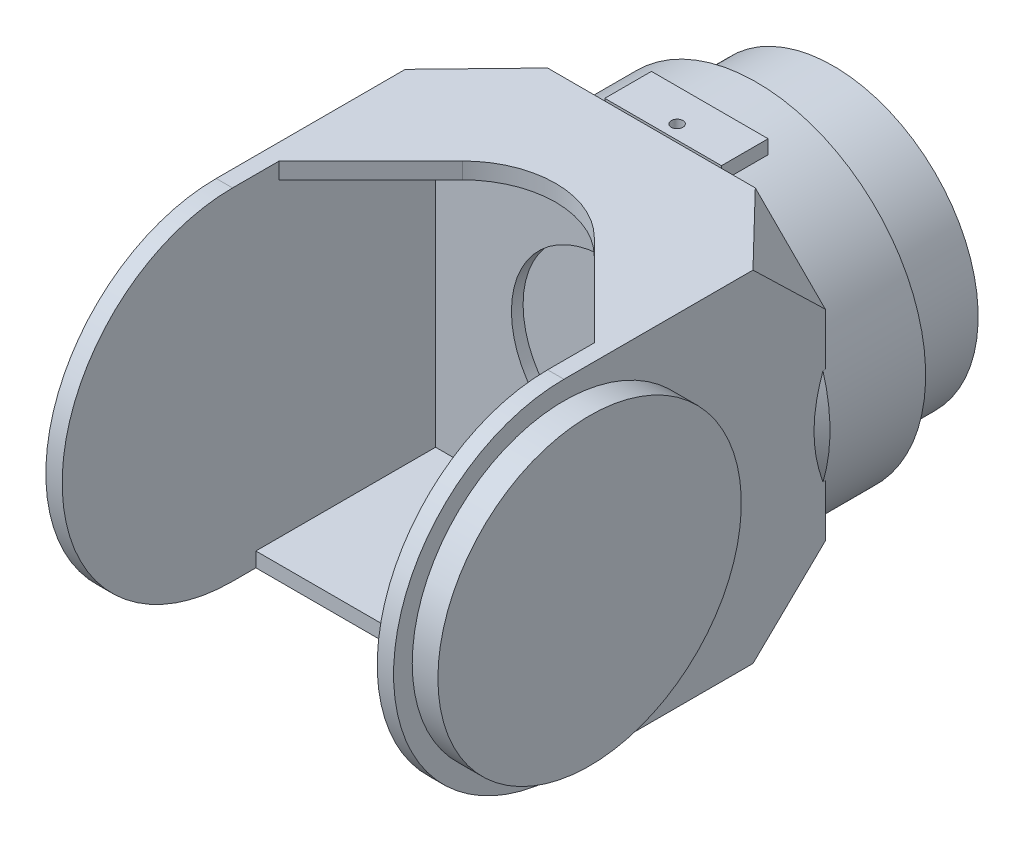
ISO-10303-21;
HEADER;
FILE_DESCRIPTION(('STEP AP214'),'2;1');
FILE_NAME('part.step','',(''),(''),'','','');
FILE_SCHEMA(('AUTOMOTIVE_DESIGN { 1 0 10303 214 1 1 1 1 }'));
ENDSEC;
DATA;
#1=APPLICATION_CONTEXT('core data for automotive mechanical design processes');
#2=APPLICATION_PROTOCOL_DEFINITION('international standard','automotive_design',2000,#1);
#3=PRODUCT_CONTEXT('',#1,'mechanical');
#4=PRODUCT('Part','Part','',(#3));
#5=PRODUCT_RELATED_PRODUCT_CATEGORY('part','',(#4));
#6=PRODUCT_DEFINITION_FORMATION('','',#4);
#7=PRODUCT_DEFINITION_CONTEXT('part definition',#1,'design');
#8=PRODUCT_DEFINITION('design','',#6,#7);
#9=PRODUCT_DEFINITION_SHAPE('','',#8);
#10=(LENGTH_UNIT() NAMED_UNIT(*) SI_UNIT(.MILLI.,.METRE.));
#11=(NAMED_UNIT(*) PLANE_ANGLE_UNIT() SI_UNIT($,.RADIAN.));
#12=(NAMED_UNIT(*) SI_UNIT($,.STERADIAN.) SOLID_ANGLE_UNIT());
#13=UNCERTAINTY_MEASURE_WITH_UNIT(LENGTH_MEASURE(1.E-05),#10,'distance_accuracy_value','');
#14=(GEOMETRIC_REPRESENTATION_CONTEXT(3) GLOBAL_UNCERTAINTY_ASSIGNED_CONTEXT((#13)) GLOBAL_UNIT_ASSIGNED_CONTEXT((#10,
#11,#12)) REPRESENTATION_CONTEXT('',''));
#15=CARTESIAN_POINT('',(0.,0.,0.));
#16=DIRECTION('',(0.,0.,1.));
#17=DIRECTION('',(1.,0.,0.));
#18=AXIS2_PLACEMENT_3D('',#15,#16,#17);
#19=CARTESIAN_POINT('',(69.5,0.,125.));
#20=DIRECTION('',(-1.,0.,0.));
#21=DIRECTION('',(0.,0.,1.));
#22=AXIS2_PLACEMENT_3D('',#19,#20,#21);
#23=CYLINDRICAL_SURFACE('',#22,73.);
#24=CARTESIAN_POINT('',(62.5,0.,125.));
#25=DIRECTION('',(1.,0.,0.));
#26=DIRECTION('',(0.,0.,-1.));
#27=AXIS2_PLACEMENT_3D('',#24,#25,#26);
#28=CIRCLE('',#27,73.);
#29=CARTESIAN_POINT('',(62.5,73.,125.));
#30=VERTEX_POINT('',#29);
#31=CARTESIAN_POINT('',(62.5,-73.,125.));
#32=VERTEX_POINT('',#31);
#33=EDGE_CURVE('E466',#30,#32,#28,.T.);
#34=ORIENTED_EDGE('',*,*,#33,.T.);
#35=DIRECTION('',(-1.,0.,0.));
#36=VECTOR('',#35,1.);
#37=CARTESIAN_POINT('',(69.5,-73.,125.));
#38=LINE('',#37,#36);
#39=CARTESIAN_POINT('',(69.5,-73.,125.));
#40=VERTEX_POINT('',#39);
#41=EDGE_CURVE('E282',#40,#32,#38,.T.);
#42=ORIENTED_EDGE('',*,*,#41,.F.);
#43=CARTESIAN_POINT('',(69.5,0.,125.));
#44=DIRECTION('',(1.,0.,0.));
#45=DIRECTION('',(0.,0.,-1.));
#46=AXIS2_PLACEMENT_3D('',#43,#44,#45);
#47=CIRCLE('',#46,73.);
#48=CARTESIAN_POINT('',(69.5,73.,125.));
#49=VERTEX_POINT('',#48);
#50=EDGE_CURVE('E504',#49,#40,#47,.T.);
#51=ORIENTED_EDGE('',*,*,#50,.F.);
#52=DIRECTION('',(-1.,0.,0.));
#53=VECTOR('',#52,1.);
#54=CARTESIAN_POINT('',(69.5,73.,125.));
#55=LINE('',#54,#53);
#56=EDGE_CURVE('E517',#49,#30,#55,.T.);
#57=ORIENTED_EDGE('',*,*,#56,.T.);
#58=EDGE_LOOP('',(#34,#42,#51,#57));
#59=FACE_BOUND('',#58,.T.);
#60=ADVANCED_FACE('F17',(#59),#23,.T.);
#61=CARTESIAN_POINT('',(0.,0.,0.));
#62=DIRECTION('',(0.,0.,-1.));
#63=DIRECTION('',(-1.,0.,0.));
#64=AXIS2_PLACEMENT_3D('',#61,#62,#63);
#65=CYLINDRICAL_SURFACE('',#64,40.);
#66=CARTESIAN_POINT('',(0.,0.,38.));
#67=DIRECTION('',(0.,0.,-1.));
#68=DIRECTION('',(-1.,0.,0.));
#69=AXIS2_PLACEMENT_3D('',#66,#67,#68);
#70=CIRCLE('',#69,40.);
#71=CARTESIAN_POINT('',(-40.,0.,38.));
#72=VERTEX_POINT('',#71);
#73=EDGE_CURVE('E444',#72,#72,#70,.T.);
#74=ORIENTED_EDGE('',*,*,#73,.F.);
#75=EDGE_LOOP('',(#74));
#76=FACE_BOUND('',#75,.T.);
#77=CARTESIAN_POINT('',(0.,0.,33.));
#78=DIRECTION('',(0.,0.,-1.));
#79=DIRECTION('',(-1.,0.,0.));
#80=AXIS2_PLACEMENT_3D('',#77,#78,#79);
#81=CIRCLE('',#80,40.);
#82=CARTESIAN_POINT('',(-40.,0.,33.));
#83=VERTEX_POINT('',#82);
#84=EDGE_CURVE('E292',#83,#83,#81,.T.);
#85=ORIENTED_EDGE('',*,*,#84,.T.);
#86=EDGE_LOOP('',(#85));
#87=FACE_BOUND('',#86,.T.);
#88=ADVANCED_FACE('F723',(#76,#87),#65,.F.);
#89=CARTESIAN_POINT('',(40.,0.,-27.));
#90=DIRECTION('',(0.,0.,-1.));
#91=DIRECTION('',(-1.,0.,0.));
#92=AXIS2_PLACEMENT_3D('',#89,#90,#91);
#93=PLANE('',#92);
#94=CARTESIAN_POINT('',(0.,0.,-27.));
#95=DIRECTION('',(0.,0.,-1.));
#96=DIRECTION('',(-1.,0.,0.));
#97=AXIS2_PLACEMENT_3D('',#94,#95,#96);
#98=CIRCLE('',#97,72.5);
#99=CARTESIAN_POINT('',(-72.5,0.,-27.));
#100=VERTEX_POINT('',#99);
#101=EDGE_CURVE('E814',#100,#100,#98,.T.);
#102=ORIENTED_EDGE('',*,*,#101,.T.);
#103=EDGE_LOOP('',(#102));
#104=FACE_BOUND('',#103,.T.);
#105=CARTESIAN_POINT('',(0.,0.,-27.));
#106=DIRECTION('',(0.,0.,-1.));
#107=DIRECTION('',(-1.,0.,0.));
#108=AXIS2_PLACEMENT_3D('',#105,#106,#107);
#109=CIRCLE('',#108,62.);
#110=CARTESIAN_POINT('',(-62.,0.,-27.));
#111=VERTEX_POINT('',#110);
#112=EDGE_CURVE('E286',#111,#111,#109,.F.);
#113=ORIENTED_EDGE('',*,*,#112,.T.);
#114=EDGE_LOOP('',(#113));
#115=FACE_BOUND('',#114,.T.);
#116=ADVANCED_FACE('F571',(#104,#115),#93,.T.);
#117=CARTESIAN_POINT('',(0.,62.,7.));
#118=DIRECTION('',(0.,1.,0.));
#119=DIRECTION('',(0.,0.,1.));
#120=AXIS2_PLACEMENT_3D('',#117,#118,#119);
#121=CONICAL_SURFACE('',#120,2.5,1.02974425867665);
#122=CARTESIAN_POINT('',(-1.41841855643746,61.9837727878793,4.97421988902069));
#123=CARTESIAN_POINT('',(-1.52907882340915,61.9812403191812,5.05685548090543));
#124=CARTESIAN_POINT('',(-1.63275458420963,61.9785699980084,5.14902509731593));
#125=CARTESIAN_POINT('',(-1.82330850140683,61.9732578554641,5.3494985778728));
#126=CARTESIAN_POINT('',(-1.91016143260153,61.9706160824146,5.45782624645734));
#127=CARTESIAN_POINT('',(-2.06491818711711,61.965652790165,5.68747096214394));
#128=CARTESIAN_POINT('',(-2.13279762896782,61.9633316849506,5.80880444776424));
#129=CARTESIAN_POINT('',(-2.24785345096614,61.9592647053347,6.06087195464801));
#130=CARTESIAN_POINT('',(-2.29503447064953,61.9575187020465,6.19160386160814));
#131=CARTESIAN_POINT('',(-2.36871584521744,61.9547463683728,6.46280540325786));
#132=CARTESIAN_POINT('',(-2.3945864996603,61.9537420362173,6.60344656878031));
#133=CARTESIAN_POINT('',(-2.42275382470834,61.9526469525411,6.88708763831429));
#134=CARTESIAN_POINT('',(-2.42504645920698,61.9525563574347,7.030087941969));
#135=CARTESIAN_POINT('',(-2.40585406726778,61.9533046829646,7.31663344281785));
#136=CARTESIAN_POINT('',(-2.38401434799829,61.9541574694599,7.4601550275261));
#137=CARTESIAN_POINT('',(-2.31649666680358,61.9567185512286,7.74147930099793));
#138=CARTESIAN_POINT('',(-2.2708183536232,61.9584268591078,7.87928190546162));
#139=CARTESIAN_POINT('',(-2.15690244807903,61.9624966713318,8.14471296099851));
#140=CARTESIAN_POINT('',(-2.08873653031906,61.9648560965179,8.27237215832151));
#141=CARTESIAN_POINT('',(-1.93151104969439,61.9699558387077,8.51410736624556));
#142=CARTESIAN_POINT('',(-1.84245344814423,61.9726961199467,8.62818465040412));
#143=CARTESIAN_POINT('',(-1.64786139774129,61.9781719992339,8.83688468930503));
#144=CARTESIAN_POINT('',(-1.54270854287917,61.980906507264,8.9318629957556));
#145=CARTESIAN_POINT('',(-1.31750409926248,61.9861019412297,9.10213338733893));
#146=CARTESIAN_POINT('',(-1.19745528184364,61.9885629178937,9.17742912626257));
#147=CARTESIAN_POINT('',(-0.949885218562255,61.9928427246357,9.30369165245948));
#148=CARTESIAN_POINT('',(-0.822714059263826,61.9946791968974,9.35534432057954));
#149=CARTESIAN_POINT('',(-0.561352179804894,61.9975962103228,9.43589425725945));
#150=CARTESIAN_POINT('',(-0.427162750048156,61.9986768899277,9.46479569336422));
#151=CARTESIAN_POINT('',(-0.159522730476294,61.9999352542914,9.49834055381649));
#152=CARTESIAN_POINT('',(-0.0261524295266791,62.0001368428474,9.50362622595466));
#153=CARTESIAN_POINT('',(0.239545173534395,61.999679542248,9.49151218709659));
#154=CARTESIAN_POINT('',(0.371872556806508,61.9990207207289,9.47411425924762));
#155=CARTESIAN_POINT('',(0.63045870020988,61.9969281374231,9.41750680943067));
#156=CARTESIAN_POINT('',(0.756762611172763,61.9955016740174,9.37850260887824));
#157=CARTESIAN_POINT('',(1.00115069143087,61.9920369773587,9.28012157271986));
#158=CARTESIAN_POINT('',(1.11923449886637,61.9899987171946,9.22074384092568));
#159=CARTESIAN_POINT('',(1.3455724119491,61.9855018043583,9.08258656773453));
#160=CARTESIAN_POINT('',(1.45367649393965,61.9830379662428,9.00356168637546));
#161=CARTESIAN_POINT('',(1.6555419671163,61.9779751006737,8.82894651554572));
#162=CARTESIAN_POINT('',(1.7493015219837,61.9753760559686,8.73335410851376));
#163=CARTESIAN_POINT('',(1.92266960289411,61.9702436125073,8.52544818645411));
#164=CARTESIAN_POINT('',(2.00180223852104,61.9677141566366,8.41273783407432));
#165=CARTESIAN_POINT('',(2.14067453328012,61.9630725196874,8.17593979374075));
#166=CARTESIAN_POINT('',(2.20041122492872,61.960960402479,8.05185036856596));
#167=CARTESIAN_POINT('',(2.30063349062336,61.9573215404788,7.79181250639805));
#168=CARTESIAN_POINT('',(2.34048603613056,61.955814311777,7.65561964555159));
#169=CARTESIAN_POINT('',(2.39727335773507,61.9536430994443,7.37852788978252));
#170=CARTESIAN_POINT('',(2.41420530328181,61.9529792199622,7.23762841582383));
#171=CARTESIAN_POINT('',(2.4248711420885,61.9525627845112,6.95214790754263));
#172=CARTESIAN_POINT('',(2.41813904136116,61.9528285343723,6.80754921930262));
#173=CARTESIAN_POINT('',(2.38059060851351,61.9542826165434,6.52150913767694));
#174=CARTESIAN_POINT('',(2.34977308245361,61.955470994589,6.38006790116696));
#175=CARTESIAN_POINT('',(2.26465992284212,61.9586404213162,6.1040116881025));
#176=CARTESIAN_POINT('',(2.21030114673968,61.9606236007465,5.96941616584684));
#177=CARTESIAN_POINT('',(2.07941776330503,61.9651538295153,5.71146770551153));
#178=CARTESIAN_POINT('',(2.00289433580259,61.9677008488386,5.58811416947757));
#179=CARTESIAN_POINT('',(1.83101494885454,61.9730153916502,5.35832528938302));
#180=CARTESIAN_POINT('',(1.73597409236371,61.9757788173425,5.25165438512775));
#181=CARTESIAN_POINT('',(1.52884687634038,61.9812336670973,5.05637729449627));
#182=CARTESIAN_POINT('',(1.41676329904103,61.9839251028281,4.9677681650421));
#183=CARTESIAN_POINT('',(1.1822178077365,61.9888352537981,4.81393530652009));
#184=CARTESIAN_POINT('',(1.06015467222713,61.9910654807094,4.7481040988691));
#185=CARTESIAN_POINT('',(0.806458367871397,61.9948843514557,4.63860331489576));
#186=CARTESIAN_POINT('',(0.674827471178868,61.9964731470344,4.59492849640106));
#187=CARTESIAN_POINT('',(0.410041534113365,61.9987811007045,4.53227391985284));
#188=CARTESIAN_POINT('',(0.277054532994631,61.9995252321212,4.51258366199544));
#189=CARTESIAN_POINT('',(0.00963855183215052,62.0001433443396,4.49619488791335));
#190=CARTESIAN_POINT('',(-0.12479061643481,62.0000172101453,4.49949941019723));
#191=CARTESIAN_POINT('',(-0.389010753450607,61.9989183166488,4.52875044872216));
#192=CARTESIAN_POINT('',(-0.518841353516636,61.9979587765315,4.5543434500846));
#193=CARTESIAN_POINT('',(-0.772288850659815,61.9953191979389,4.62681491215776));
#194=CARTESIAN_POINT('',(-0.895912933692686,61.9936400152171,4.67366809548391));
#195=CARTESIAN_POINT('',(-1.08582906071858,61.9905320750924,4.76423319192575));
#196=CARTESIAN_POINT('',(-1.15520255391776,61.9892736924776,4.80164618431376));
#197=CARTESIAN_POINT('',(-1.28994710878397,61.9866160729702,4.88307960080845));
#198=CARTESIAN_POINT('',(-1.35531832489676,61.9852168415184,4.92709976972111));
#199=CARTESIAN_POINT('',(-1.41841855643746,61.9837727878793,4.97421988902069));
#200=B_SPLINE_CURVE_WITH_KNOTS('',3,(#122,#123,#124,#125,#126,#127,#128,#129,#130,#131,#132,
#133,#134,#135,#136,#137,#138,#139,#140,#141,#142,#143,#144,#145,#146,#147,#148,#149,#150,#151,
#152,#153,#154,#155,#156,#157,#158,#159,#160,#161,#162,#163,#164,#165,#166,#167,#168,#169,#170,
#171,#172,#173,#174,#175,#176,#177,#178,#179,#180,#181,#182,#183,#184,#185,#186,#187,#188,#189,
#190,#191,#192,#193,#194,#195,#196,#197,#198,#199),.UNSPECIFIED.,.T.,.F.,(4,2,2,2,2,2,2,2,2,2,2,
2,2,2,2,2,2,2,2,2,2,2,2,2,2,2,2,2,2,2,2,2,2,2,2,2,2,2,4),(0.,0.41410766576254,0.828831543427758,
1.2440859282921,1.65924718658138,2.08627568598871,2.51337728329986,2.9468408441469,
3.38031079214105,3.81241228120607,4.24447322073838,4.66753989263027,5.09052797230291,
5.50031637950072,5.91002970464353,6.3085299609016,6.70699889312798,7.10174462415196,
7.49650772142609,7.89647244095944,8.29648831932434,8.70783133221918,9.11923724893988,
9.54301654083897,9.9668481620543,10.399072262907,10.831317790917,11.2647299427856,
11.6981190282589,12.1246922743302,12.5511959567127,12.9652415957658,13.3791892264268,
13.7805503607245,14.181964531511,14.5771255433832,14.9718179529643,15.2079578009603,
15.4440885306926),.UNSPECIFIED.);
#201=CARTESIAN_POINT('',(0.,62.,9.5));
#202=VERTEX_POINT('',#201);
#203=CARTESIAN_POINT('',(0.,62.,4.5));
#204=VERTEX_POINT('',#203);
#205=EDGE_CURVE('E26',#202,#204,#200,.T.);
#206=ORIENTED_EDGE('',*,*,#205,.F.);
#207=CARTESIAN_POINT('',(0.,62.,7.));
#208=DIRECTION('',(0.,1.,0.));
#209=DIRECTION('',(0.,0.,1.));
#210=AXIS2_PLACEMENT_3D('',#207,#208,#209);
#211=CIRCLE('',#210,2.5);
#212=EDGE_CURVE('E349',#202,#204,#211,.T.);
#213=ORIENTED_EDGE('',*,*,#212,.T.);
#214=EDGE_LOOP('',(#206,#213));
#215=FACE_BOUND('',#214,.T.);
#216=ADVANCED_FACE('F614',(#215),#121,.F.);
#217=EDGE_CURVE('E39',#204,#202,#200,.T.);
#218=ORIENTED_EDGE('',*,*,#217,.F.);
#219=EDGE_CURVE('E348',#204,#202,#211,.T.);
#220=ORIENTED_EDGE('',*,*,#219,.T.);
#221=EDGE_LOOP('',(#218,#220));
#222=FACE_BOUND('',#221,.T.);
#223=ADVANCED_FACE('F618',(#222),#121,.F.);
#224=CARTESIAN_POINT('',(69.5,-73.,13.));
#225=DIRECTION('',(0.,0.,1.));
#226=DIRECTION('',(0.,-1.,0.));
#227=AXIS2_PLACEMENT_3D('',#224,#225,#226);
#228=PLANE('',#227);
#229=DIRECTION('',(0.,1.,0.));
#230=VECTOR('',#229,1.);
#231=CARTESIAN_POINT('',(7.96057998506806,-77.,13.));
#232=LINE('',#231,#230);
#233=CARTESIAN_POINT('',(7.96057998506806,-72.0616344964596,13.));
#234=VERTEX_POINT('',#233);
#235=CARTESIAN_POINT('',(7.96057998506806,-73.,13.));
#236=VERTEX_POINT('',#235);
#237=EDGE_CURVE('E298',#234,#236,#232,.F.);
#238=ORIENTED_EDGE('',*,*,#237,.F.);
#239=CARTESIAN_POINT('',(0.,0.,13.));
#240=DIRECTION('',(0.,0.,1.));
#241=DIRECTION('',(0.,-1.,0.));
#242=AXIS2_PLACEMENT_3D('',#239,#240,#241);
#243=CIRCLE('',#242,72.5);
#244=CARTESIAN_POINT('',(69.5,-20.6397674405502,13.));
#245=VERTEX_POINT('',#244);
#246=EDGE_CURVE('E817',#245,#234,#243,.F.);
#247=ORIENTED_EDGE('',*,*,#246,.F.);
#248=DIRECTION('',(0.,1.,0.));
#249=VECTOR('',#248,1.);
#250=CARTESIAN_POINT('',(69.5,-73.,13.));
#251=LINE('',#250,#249);
#252=CARTESIAN_POINT('',(69.5,-43.,13.));
#253=VERTEX_POINT('',#252);
#254=EDGE_CURVE('E511',#253,#245,#251,.T.);
#255=ORIENTED_EDGE('',*,*,#254,.F.);
#256=DIRECTION('',(-0.707106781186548,-0.707106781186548,0.));
#257=VECTOR('',#256,1.);
#258=CARTESIAN_POINT('',(69.5,-43.,13.));
#259=LINE('',#258,#257);
#260=CARTESIAN_POINT('',(39.5,-73.,13.));
#261=VERTEX_POINT('',#260);
#262=EDGE_CURVE('E385',#253,#261,#259,.T.);
#263=ORIENTED_EDGE('',*,*,#262,.T.);
#264=DIRECTION('',(-1.,0.,0.));
#265=VECTOR('',#264,1.);
#266=CARTESIAN_POINT('',(69.5,-73.,13.));
#267=LINE('',#266,#265);
#268=EDGE_CURVE('E524',#261,#236,#267,.T.);
#269=ORIENTED_EDGE('',*,*,#268,.T.);
#270=EDGE_LOOP('',(#238,#247,#255,#263,#269));
#271=FACE_BOUND('',#270,.T.);
#272=ADVANCED_FACE('F556',(#271),#228,.F.);
#273=DIRECTION('',(0.,1.,0.));
#274=VECTOR('',#273,1.);
#275=CARTESIAN_POINT('',(-8.84933428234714,-77.,13.));
#276=LINE('',#275,#274);
#277=CARTESIAN_POINT('',(-8.84933428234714,-73.,13.));
#278=VERTEX_POINT('',#277);
#279=CARTESIAN_POINT('',(-8.84933428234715,-71.9578993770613,13.));
#280=VERTEX_POINT('',#279);
#281=EDGE_CURVE('E296',#278,#280,#276,.T.);
#282=ORIENTED_EDGE('',*,*,#281,.F.);
#283=CARTESIAN_POINT('',(-49.5,-73.,13.));
#284=VERTEX_POINT('',#283);
#285=EDGE_CURVE('E523',#278,#284,#267,.T.);
#286=ORIENTED_EDGE('',*,*,#285,.T.);
#287=DIRECTION('',(-0.707106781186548,0.707106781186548,0.));
#288=VECTOR('',#287,1.);
#289=CARTESIAN_POINT('',(-49.5,-73.,13.));
#290=LINE('',#289,#288);
#291=CARTESIAN_POINT('',(-79.5,-43.,13.));
#292=VERTEX_POINT('',#291);
#293=EDGE_CURVE('E395',#284,#292,#290,.T.);
#294=ORIENTED_EDGE('',*,*,#293,.T.);
#295=DIRECTION('',(0.,1.,0.));
#296=VECTOR('',#295,1.);
#297=CARTESIAN_POINT('',(-79.5,-73.,13.));
#298=LINE('',#297,#296);
#299=CARTESIAN_POINT('',(-79.5,-15.,13.));
#300=VERTEX_POINT('',#299);
#301=EDGE_CURVE('E498',#292,#300,#298,.T.);
#302=ORIENTED_EDGE('',*,*,#301,.T.);
#303=DIRECTION('',(-1.,0.,0.));
#304=VECTOR('',#303,1.);
#305=CARTESIAN_POINT('',(80.501,-15.,13.));
#306=LINE('',#305,#304);
#307=CARTESIAN_POINT('',(-70.9313047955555,-15.,13.));
#308=VERTEX_POINT('',#307);
#309=EDGE_CURVE('E373',#308,#300,#306,.T.);
#310=ORIENTED_EDGE('',*,*,#309,.F.);
#311=EDGE_CURVE('E819',#280,#308,#243,.F.);
#312=ORIENTED_EDGE('',*,*,#311,.F.);
#313=EDGE_LOOP('',(#282,#286,#294,#302,#310,#312));
#314=FACE_BOUND('',#313,.T.);
#315=ADVANCED_FACE('F560',(#314),#228,.F.);
#316=CARTESIAN_POINT('',(69.5,-73.,125.));
#317=DIRECTION('',(0.,1.,0.));
#318=DIRECTION('',(0.,0.,1.));
#319=AXIS2_PLACEMENT_3D('',#316,#317,#318);
#320=PLANE('',#319);
#321=ORIENTED_EDGE('',*,*,#41,.T.);
#322=DIRECTION('',(0.,0.,-1.));
#323=VECTOR('',#322,1.);
#324=CARTESIAN_POINT('',(62.5,-73.,125.));
#325=LINE('',#324,#323);
#326=CARTESIAN_POINT('',(62.5,-73.,115.));
#327=VERTEX_POINT('',#326);
#328=EDGE_CURVE('E275',#32,#327,#325,.T.);
#329=ORIENTED_EDGE('',*,*,#328,.T.);
#330=DIRECTION('',(-1.,0.,0.));
#331=VECTOR('',#330,1.);
#332=CARTESIAN_POINT('',(69.5,-73.,115.));
#333=LINE('',#332,#331);
#334=CARTESIAN_POINT('',(-72.5,-73.,115.));
#335=VERTEX_POINT('',#334);
#336=EDGE_CURVE('E262',#327,#335,#333,.T.);
#337=ORIENTED_EDGE('',*,*,#336,.T.);
#338=DIRECTION('',(0.,0.,1.));
#339=VECTOR('',#338,1.);
#340=CARTESIAN_POINT('',(-72.5,-73.,125.));
#341=LINE('',#340,#339);
#342=CARTESIAN_POINT('',(-72.5,-73.,125.));
#343=VERTEX_POINT('',#342);
#344=EDGE_CURVE('E269',#335,#343,#341,.T.);
#345=ORIENTED_EDGE('',*,*,#344,.T.);
#346=CARTESIAN_POINT('',(-79.5,-73.,125.));
#347=VERTEX_POINT('',#346);
#348=EDGE_CURVE('E527',#343,#347,#38,.T.);
#349=ORIENTED_EDGE('',*,*,#348,.T.);
#350=DIRECTION('',(0.,0.,-1.));
#351=VECTOR('',#350,1.);
#352=CARTESIAN_POINT('',(-79.5,-73.,125.));
#353=LINE('',#352,#351);
#354=CARTESIAN_POINT('',(-79.5,-73.,44.));
#355=VERTEX_POINT('',#354);
#356=EDGE_CURVE('E494',#347,#355,#353,.T.);
#357=ORIENTED_EDGE('',*,*,#356,.T.);
#358=DIRECTION('',(0.695421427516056,0.,-0.718602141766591));
#359=VECTOR('',#358,1.);
#360=CARTESIAN_POINT('',(-94.0042324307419,-73.,58.9877068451));
#361=LINE('',#360,#359);
#362=EDGE_CURVE('E398',#355,#284,#361,.T.);
#363=ORIENTED_EDGE('',*,*,#362,.T.);
#364=ORIENTED_EDGE('',*,*,#285,.F.);
#365=CARTESIAN_POINT('',(-0.444377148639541,-73.,20.0962451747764));
#366=DIRECTION('',(0.,1.,0.));
#367=DIRECTION('',(0.,0.,1.));
#368=AXIS2_PLACEMENT_3D('',#365,#366,#367);
#369=CIRCLE('',#368,11.);
#370=EDGE_CURVE('E300',#236,#278,#369,.F.);
#371=ORIENTED_EDGE('',*,*,#370,.F.);
#372=ORIENTED_EDGE('',*,*,#268,.F.);
#373=DIRECTION('',(-0.695421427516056,0.,-0.718602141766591));
#374=VECTOR('',#373,1.);
#375=CARTESIAN_POINT('',(69.5,-73.,44.));
#376=LINE('',#375,#374);
#377=CARTESIAN_POINT('',(69.5,-73.,44.));
#378=VERTEX_POINT('',#377);
#379=EDGE_CURVE('E388',#378,#261,#376,.T.);
#380=ORIENTED_EDGE('',*,*,#379,.F.);
#381=DIRECTION('',(0.,0.,-1.));
#382=VECTOR('',#381,1.);
#383=CARTESIAN_POINT('',(69.5,-73.,125.));
#384=LINE('',#383,#382);
#385=EDGE_CURVE('E507',#40,#378,#384,.T.);
#386=ORIENTED_EDGE('',*,*,#385,.F.);
#387=EDGE_LOOP('',(#321,#329,#337,#345,#349,#357,#363,#364,#371,#372,#380,#386));
#388=FACE_BOUND('',#387,.T.);
#389=ADVANCED_FACE('F280',(#388),#320,.F.);
#390=CARTESIAN_POINT('',(0.,0.,0.));
#391=DIRECTION('',(0.,0.,-1.));
#392=DIRECTION('',(-1.,0.,0.));
#393=AXIS2_PLACEMENT_3D('',#390,#391,#392);
#394=CYLINDRICAL_SURFACE('',#393,72.5);
#395=ORIENTED_EDGE('',*,*,#101,.F.);
#396=EDGE_LOOP('',(#395));
#397=FACE_BOUND('',#396,.T.);
#398=ORIENTED_EDGE('',*,*,#246,.T.);
#399=CARTESIAN_POINT('',(8.71181172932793,-71.9746784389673,14.));
#400=CARTESIAN_POINT('',(8.54014399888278,-71.9954560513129,13.7421102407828));
#401=CARTESIAN_POINT('',(8.35756246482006,-72.016933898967,13.4915522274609));
#402=CARTESIAN_POINT('',(7.97197596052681,-72.0606360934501,13.0067643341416));
#403=CARTESIAN_POINT('',(7.76897191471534,-72.0828604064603,12.7725337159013));
#404=CARTESIAN_POINT('',(7.34400438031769,-72.127395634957,12.3221217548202));
#405=CARTESIAN_POINT('',(7.1220476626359,-72.14970651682,12.1059340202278));
#406=CARTESIAN_POINT('',(6.66066651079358,-72.1937616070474,11.6930206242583));
#407=CARTESIAN_POINT('',(6.42124226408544,-72.2155058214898,11.49629475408));
#408=CARTESIAN_POINT('',(5.92645318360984,-72.257794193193,11.1235919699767));
#409=CARTESIAN_POINT('',(5.67107994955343,-72.2783377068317,10.9476261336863));
#410=CARTESIAN_POINT('',(5.1462903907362,-72.3175975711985,10.6178234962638));
#411=CARTESIAN_POINT('',(4.87687416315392,-72.3363139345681,10.463986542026));
#412=CARTESIAN_POINT('',(4.32597340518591,-72.3713486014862,10.1796017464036));
#413=CARTESIAN_POINT('',(4.04449264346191,-72.3876676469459,10.0490466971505));
#414=CARTESIAN_POINT('',(3.47137961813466,-72.417413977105,9.8121315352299));
#415=CARTESIAN_POINT('',(3.17974744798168,-72.4308412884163,9.70577119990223));
#416=CARTESIAN_POINT('',(2.5897439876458,-72.4543303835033,9.51846300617));
#417=CARTESIAN_POINT('',(2.29140882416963,-72.4644070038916,9.43740321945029));
#418=CARTESIAN_POINT('',(1.68887850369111,-72.48095274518,9.30066022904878));
#419=CARTESIAN_POINT('',(1.38468335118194,-72.4874218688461,9.24497700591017));
#420=CARTESIAN_POINT('',(0.772582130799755,-72.4965296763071,9.15940274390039));
#421=CARTESIAN_POINT('',(0.464675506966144,-72.4991677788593,9.12951561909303));
#422=CARTESIAN_POINT('',(-0.152568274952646,-72.500496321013,9.09577346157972));
#423=CARTESIAN_POINT('',(-0.46190542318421,-72.499186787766,9.09191824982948));
#424=CARTESIAN_POINT('',(-1.07691311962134,-72.4926476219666,9.11017818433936));
#425=CARTESIAN_POINT('',(-1.38259118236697,-72.487454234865,9.13205427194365));
#426=CARTESIAN_POINT('',(-1.99096990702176,-72.4732959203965,9.20121067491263));
#427=CARTESIAN_POINT('',(-2.29367058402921,-72.4643310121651,9.24849086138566));
#428=CARTESIAN_POINT('',(-2.89391573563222,-72.4428425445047,9.36808599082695));
#429=CARTESIAN_POINT('',(-3.1914608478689,-72.4303194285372,9.44039781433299));
#430=CARTESIAN_POINT('',(-3.77934608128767,-72.4020245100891,9.60951379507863));
#431=CARTESIAN_POINT('',(-4.06968622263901,-72.3862527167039,9.70631788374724));
#432=CARTESIAN_POINT('',(-4.64161588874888,-72.3518321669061,9.92388305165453));
#433=CARTESIAN_POINT('',(-4.92319028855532,-72.33317873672,10.0446831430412));
#434=CARTESIAN_POINT('',(-5.47515229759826,-72.2934940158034,10.3092656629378));
#435=CARTESIAN_POINT('',(-5.74553983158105,-72.2724627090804,10.4530482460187));
#436=CARTESIAN_POINT('',(-6.27329349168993,-72.2285672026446,10.7625787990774));
#437=CARTESIAN_POINT('',(-6.53065890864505,-72.2057029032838,10.9283279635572));
#438=CARTESIAN_POINT('',(-7.0305954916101,-72.1587400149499,11.2806215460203));
#439=CARTESIAN_POINT('',(-7.27316810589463,-72.1346415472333,11.4671639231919));
#440=CARTESIAN_POINT('',(-7.7086781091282,-72.0893002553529,11.8319363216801));
#441=CARTESIAN_POINT('',(-7.90377947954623,-72.068136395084,12.0076015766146));
#442=CARTESIAN_POINT('',(-8.28090967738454,-72.0257768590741,12.3724134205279));
#443=CARTESIAN_POINT('',(-8.46293992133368,-72.0045811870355,12.5615585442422));
#444=CARTESIAN_POINT('',(-8.81291179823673,-71.9625850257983,12.9522725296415));
#445=CARTESIAN_POINT('',(-8.98086272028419,-71.9417842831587,13.1538330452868));
#446=CARTESIAN_POINT('',(-9.30200229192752,-71.900966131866,13.5685083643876));
#447=CARTESIAN_POINT('',(-9.45518892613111,-71.880948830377,13.7816247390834));
#448=CARTESIAN_POINT('',(-9.60056602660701,-71.8615274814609,14.));
#449=B_SPLINE_CURVE_WITH_KNOTS('',3,(#399,#400,#401,#402,#403,#404,#405,#406,#407,#408,#409,
#410,#411,#412,#413,#414,#415,#416,#417,#418,#419,#420,#421,#422,#423,#424,#425,#426,#427,#428,
#429,#430,#431,#432,#433,#434,#435,#436,#437,#438,#439,#440,#441,#442,#443,#444,#445,#446,#447,
#448),.UNSPECIFIED.,.F.,.F.,(4,2,2,2,2,2,2,2,2,2,2,2,2,2,2,2,2,2,2,2,2,2,2,2,4),(0.,
0.931204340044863,1.86236654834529,2.79319747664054,3.72401841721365,4.65533382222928,
5.58664278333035,6.51766291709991,7.44867448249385,8.3755069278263,9.30233866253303,
10.2293110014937,11.1562769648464,12.0746984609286,12.9931152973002,13.9114177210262,
14.8297175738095,15.749522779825,16.6693341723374,17.589195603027,18.5089668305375,
19.2984671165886,20.0878817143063,20.8767713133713,21.6657684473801),.UNSPECIFIED.);
#450=EDGE_CURVE('E573',#234,#280,#449,.T.);
#451=ORIENTED_EDGE('',*,*,#450,.T.);
#452=ORIENTED_EDGE('',*,*,#311,.T.);
#453=DIRECTION('',(0.,0.,-1.));
#454=VECTOR('',#453,1.);
#455=CARTESIAN_POINT('',(-70.9313047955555,-15.,0.));
#456=LINE('',#455,#454);
#457=CARTESIAN_POINT('',(-70.9313047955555,-15.,-7.));
#458=VERTEX_POINT('',#457);
#459=EDGE_CURVE('E365',#308,#458,#456,.T.);
#460=ORIENTED_EDGE('',*,*,#459,.T.);
#461=CARTESIAN_POINT('',(0.,0.,-7.));
#462=DIRECTION('',(0.,0.,-1.));
#463=DIRECTION('',(0.,1.,0.));
#464=AXIS2_PLACEMENT_3D('',#461,#462,#463);
#465=CIRCLE('',#464,72.5);
#466=CARTESIAN_POINT('',(-70.9313047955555,15.,-7.));
#467=VERTEX_POINT('',#466);
#468=EDGE_CURVE('E370',#458,#467,#465,.T.);
#469=ORIENTED_EDGE('',*,*,#468,.T.);
#470=DIRECTION('',(0.,0.,-1.));
#471=VECTOR('',#470,1.);
#472=CARTESIAN_POINT('',(-70.9313047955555,15.,0.));
#473=LINE('',#472,#471);
#474=CARTESIAN_POINT('',(-70.9313047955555,15.,13.));
#475=VERTEX_POINT('',#474);
#476=EDGE_CURVE('E367',#467,#475,#473,.F.);
#477=ORIENTED_EDGE('',*,*,#476,.T.);
#478=CARTESIAN_POINT('',(-25.,68.053287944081,13.));
#479=VERTEX_POINT('',#478);
#480=EDGE_CURVE('E776',#475,#479,#243,.F.);
#481=ORIENTED_EDGE('',*,*,#480,.T.);
#482=DIRECTION('',(0.,0.,-1.));
#483=VECTOR('',#482,1.);
#484=CARTESIAN_POINT('',(-25.,68.053287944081,0.));
#485=LINE('',#484,#483);
#486=CARTESIAN_POINT('',(-25.,68.053287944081,-7.));
#487=VERTEX_POINT('',#486);
#488=EDGE_CURVE('E469',#479,#487,#485,.T.);
#489=ORIENTED_EDGE('',*,*,#488,.T.);
#490=CARTESIAN_POINT('',(0.,0.,-7.));
#491=DIRECTION('',(0.,0.,-1.));
#492=DIRECTION('',(0.,1.,0.));
#493=AXIS2_PLACEMENT_3D('',#490,#491,#492);
#494=CIRCLE('',#493,72.5);
#495=CARTESIAN_POINT('',(25.,68.053287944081,-7.));
#496=VERTEX_POINT('',#495);
#497=EDGE_CURVE('E471',#487,#496,#494,.T.);
#498=ORIENTED_EDGE('',*,*,#497,.T.);
#499=DIRECTION('',(0.,0.,-1.));
#500=VECTOR('',#499,1.);
#501=CARTESIAN_POINT('',(25.,68.053287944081,0.));
#502=LINE('',#501,#500);
#503=CARTESIAN_POINT('',(25.,68.053287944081,13.));
#504=VERTEX_POINT('',#503);
#505=EDGE_CURVE('E478',#496,#504,#502,.F.);
#506=ORIENTED_EDGE('',*,*,#505,.T.);
#507=CARTESIAN_POINT('',(69.5,20.6397674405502,13.));
#508=VERTEX_POINT('',#507);
#509=EDGE_CURVE('E768',#504,#508,#243,.F.);
#510=ORIENTED_EDGE('',*,*,#509,.T.);
#511=DIRECTION('',(0.,0.,-1.));
#512=VECTOR('',#511,1.);
#513=CARTESIAN_POINT('',(69.5,20.6397674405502,0.));
#514=LINE('',#513,#512);
#515=CARTESIAN_POINT('',(69.5,20.6397674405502,14.));
#516=VERTEX_POINT('',#515);
#517=EDGE_CURVE('E810',#516,#508,#514,.T.);
#518=ORIENTED_EDGE('',*,*,#517,.F.);
#519=CARTESIAN_POINT('',(0.,0.,14.));
#520=DIRECTION('',(0.,0.,-1.));
#521=DIRECTION('',(-1.,0.,0.));
#522=AXIS2_PLACEMENT_3D('',#519,#520,#521);
#523=CIRCLE('',#522,72.5);
#524=CARTESIAN_POINT('',(69.5,-20.6397674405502,14.));
#525=VERTEX_POINT('',#524);
#526=EDGE_CURVE('E536',#516,#525,#523,.T.);
#527=ORIENTED_EDGE('',*,*,#526,.T.);
#528=DIRECTION('',(0.,0.,-1.));
#529=VECTOR('',#528,1.);
#530=CARTESIAN_POINT('',(69.5,-20.6397674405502,0.));
#531=LINE('',#530,#529);
#532=EDGE_CURVE('E740',#245,#525,#531,.F.);
#533=ORIENTED_EDGE('',*,*,#532,.F.);
#534=EDGE_LOOP('',(#398,#451,#452,#460,#469,#477,#481,#489,#498,#506,#510,#518,#527,#533));
#535=FACE_BOUND('',#534,.T.);
#536=ADVANCED_FACE('F559',(#397,#535),#394,.T.);
#537=CARTESIAN_POINT('',(-90.,-15.,-7.));
#538=DIRECTION('',(-1.,0.,0.));
#539=DIRECTION('',(0.,0.,1.));
#540=AXIS2_PLACEMENT_3D('',#537,#538,#539);
#541=PLANE('',#540);
#542=DIRECTION('',(0.,0.,1.));
#543=VECTOR('',#542,1.);
#544=CARTESIAN_POINT('',(-90.,-4.75,-27.001));
#545=LINE('',#544,#543);
#546=CARTESIAN_POINT('',(-90.,-4.75,-7.));
#547=VERTEX_POINT('',#546);
#548=CARTESIAN_POINT('',(-90.,-4.75,13.));
#549=VERTEX_POINT('',#548);
#550=EDGE_CURVE('E307',#547,#549,#545,.T.);
#551=ORIENTED_EDGE('',*,*,#550,.T.);
#552=DIRECTION('',(0.,-1.,0.));
#553=VECTOR('',#552,1.);
#554=CARTESIAN_POINT('',(-90.,15.,13.));
#555=LINE('',#554,#553);
#556=CARTESIAN_POINT('',(-90.,-3.75,13.));
#557=VERTEX_POINT('',#556);
#558=EDGE_CURVE('E345',#557,#549,#555,.T.);
#559=ORIENTED_EDGE('',*,*,#558,.F.);
#560=DIRECTION('',(0.,0.,1.));
#561=VECTOR('',#560,1.);
#562=CARTESIAN_POINT('',(-90.,-3.75,-27.001));
#563=LINE('',#562,#561);
#564=CARTESIAN_POINT('',(-90.,-3.75,-7.));
#565=VERTEX_POINT('',#564);
#566=EDGE_CURVE('E333',#565,#557,#563,.T.);
#567=ORIENTED_EDGE('',*,*,#566,.F.);
#568=DIRECTION('',(0.,-1.,0.));
#569=VECTOR('',#568,1.);
#570=CARTESIAN_POINT('',(-90.,15.,-7.));
#571=LINE('',#570,#569);
#572=EDGE_CURVE('E342',#565,#547,#571,.T.);
#573=ORIENTED_EDGE('',*,*,#572,.T.);
#574=EDGE_LOOP('',(#551,#559,#567,#573));
#575=FACE_BOUND('',#574,.T.);
#576=ADVANCED_FACE('F569',(#575),#541,.T.);
#577=CARTESIAN_POINT('',(80.501,15.,13.));
#578=DIRECTION('',(0.,0.,1.));
#579=DIRECTION('',(0.,-1.,0.));
#580=AXIS2_PLACEMENT_3D('',#577,#578,#579);
#581=PLANE('',#580);
#582=DIRECTION('',(-0.5,0.866025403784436,0.));
#583=VECTOR('',#582,1.);
#584=CARTESIAN_POINT('',(-90.,-4.75,13.));
#585=LINE('',#584,#583);
#586=CARTESIAN_POINT('',(-84.0821597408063,-15.,13.));
#587=VERTEX_POINT('',#586);
#588=EDGE_CURVE('E305',#587,#549,#585,.T.);
#589=ORIENTED_EDGE('',*,*,#588,.F.);
#590=EDGE_CURVE('E376',#300,#587,#306,.T.);
#591=ORIENTED_EDGE('',*,*,#590,.F.);
#592=DIRECTION('',(0.,-1.,0.));
#593=VECTOR('',#592,1.);
#594=CARTESIAN_POINT('',(-79.5,0.,13.));
#595=LINE('',#594,#593);
#596=CARTESIAN_POINT('',(-79.5,15.,13.));
#597=VERTEX_POINT('',#596);
#598=EDGE_CURVE('E383',#597,#300,#595,.T.);
#599=ORIENTED_EDGE('',*,*,#598,.F.);
#600=DIRECTION('',(-1.,0.,0.));
#601=VECTOR('',#600,1.);
#602=CARTESIAN_POINT('',(80.501,15.,13.));
#603=LINE('',#602,#601);
#604=CARTESIAN_POINT('',(-84.0821597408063,15.,13.));
#605=VERTEX_POINT('',#604);
#606=EDGE_CURVE('E372',#597,#605,#603,.T.);
#607=ORIENTED_EDGE('',*,*,#606,.T.);
#608=DIRECTION('',(0.5,0.866025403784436,0.));
#609=VECTOR('',#608,1.);
#610=CARTESIAN_POINT('',(-90.,4.75,13.));
#611=LINE('',#610,#609);
#612=CARTESIAN_POINT('',(-90.,4.75,13.));
#613=VERTEX_POINT('',#612);
#614=EDGE_CURVE('E319',#613,#605,#611,.T.);
#615=ORIENTED_EDGE('',*,*,#614,.F.);
#616=CARTESIAN_POINT('',(-90.,3.75,13.));
#617=VERTEX_POINT('',#616);
#618=EDGE_CURVE('E346',#613,#617,#555,.T.);
#619=ORIENTED_EDGE('',*,*,#618,.T.);
#620=DIRECTION('',(-0.5,0.866025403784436,0.));
#621=VECTOR('',#620,1.);
#622=CARTESIAN_POINT('',(-90.,3.75,13.));
#623=LINE('',#622,#621);
#624=CARTESIAN_POINT('',(-87.8349364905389,0.,13.));
#625=VERTEX_POINT('',#624);
#626=EDGE_CURVE('E329',#625,#617,#623,.T.);
#627=ORIENTED_EDGE('',*,*,#626,.F.);
#628=DIRECTION('',(0.5,0.866025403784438,0.));
#629=VECTOR('',#628,1.);
#630=CARTESIAN_POINT('',(-87.8349364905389,0.,13.));
#631=LINE('',#630,#629);
#632=EDGE_CURVE('E326',#557,#625,#631,.T.);
#633=ORIENTED_EDGE('',*,*,#632,.F.);
#634=ORIENTED_EDGE('',*,*,#558,.T.);
#635=EDGE_LOOP('',(#589,#591,#599,#607,#615,#619,#627,#633,#634));
#636=FACE_BOUND('',#635,.T.);
#637=ADVANCED_FACE('F628',(#636),#581,.T.);
#638=CARTESIAN_POINT('',(80.501,15.,-7.));
#639=DIRECTION('',(0.,0.,-1.));
#640=DIRECTION('',(0.,1.,0.));
#641=AXIS2_PLACEMENT_3D('',#638,#639,#640);
#642=PLANE('',#641);
#643=DIRECTION('',(-0.5,0.866025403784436,0.));
#644=VECTOR('',#643,1.);
#645=CARTESIAN_POINT('',(-90.,-4.75,-7.));
#646=LINE('',#645,#644);
#647=CARTESIAN_POINT('',(-84.0821597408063,-15.,-7.));
#648=VERTEX_POINT('',#647);
#649=EDGE_CURVE('E310',#648,#547,#646,.T.);
#650=ORIENTED_EDGE('',*,*,#649,.T.);
#651=ORIENTED_EDGE('',*,*,#572,.F.);
#652=DIRECTION('',(0.5,0.866025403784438,0.));
#653=VECTOR('',#652,1.);
#654=CARTESIAN_POINT('',(-87.8349364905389,0.,-7.));
#655=LINE('',#654,#653);
#656=CARTESIAN_POINT('',(-87.8349364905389,0.,-7.));
#657=VERTEX_POINT('',#656);
#658=EDGE_CURVE('E323',#565,#657,#655,.T.);
#659=ORIENTED_EDGE('',*,*,#658,.T.);
#660=DIRECTION('',(-0.5,0.866025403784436,0.));
#661=VECTOR('',#660,1.);
#662=CARTESIAN_POINT('',(-90.,3.75,-7.));
#663=LINE('',#662,#661);
#664=CARTESIAN_POINT('',(-90.,3.75,-7.));
#665=VERTEX_POINT('',#664);
#666=EDGE_CURVE('E335',#657,#665,#663,.T.);
#667=ORIENTED_EDGE('',*,*,#666,.T.);
#668=CARTESIAN_POINT('',(-90.,4.75,-7.));
#669=VERTEX_POINT('',#668);
#670=EDGE_CURVE('E343',#669,#665,#571,.T.);
#671=ORIENTED_EDGE('',*,*,#670,.F.);
#672=DIRECTION('',(0.5,0.866025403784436,0.));
#673=VECTOR('',#672,1.);
#674=CARTESIAN_POINT('',(-90.,4.75,-7.));
#675=LINE('',#674,#673);
#676=CARTESIAN_POINT('',(-84.0821597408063,15.,-7.));
#677=VERTEX_POINT('',#676);
#678=EDGE_CURVE('E316',#669,#677,#675,.T.);
#679=ORIENTED_EDGE('',*,*,#678,.T.);
#680=DIRECTION('',(-1.,0.,0.));
#681=VECTOR('',#680,1.);
#682=CARTESIAN_POINT('',(80.501,15.,-7.));
#683=LINE('',#682,#681);
#684=EDGE_CURVE('E364',#467,#677,#683,.T.);
#685=ORIENTED_EDGE('',*,*,#684,.F.);
#686=ORIENTED_EDGE('',*,*,#468,.F.);
#687=DIRECTION('',(-1.,0.,0.));
#688=VECTOR('',#687,1.);
#689=CARTESIAN_POINT('',(80.501,-15.,-7.));
#690=LINE('',#689,#688);
#691=EDGE_CURVE('E377',#458,#648,#690,.T.);
#692=ORIENTED_EDGE('',*,*,#691,.T.);
#693=EDGE_LOOP('',(#650,#651,#659,#667,#671,#679,#685,#686,#692));
#694=FACE_BOUND('',#693,.T.);
#695=ADVANCED_FACE('F631',(#694),#642,.T.);
#696=CARTESIAN_POINT('',(80.501,-15.,-7.));
#697=DIRECTION('',(0.,-1.,0.));
#698=DIRECTION('',(0.,0.,-1.));
#699=AXIS2_PLACEMENT_3D('',#696,#697,#698);
#700=PLANE('',#699);
#701=DIRECTION('',(0.,0.,-1.));
#702=VECTOR('',#701,1.);
#703=CARTESIAN_POINT('',(-84.0821597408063,-15.,-27.001));
#704=LINE('',#703,#702);
#705=EDGE_CURVE('E302',#587,#648,#704,.T.);
#706=ORIENTED_EDGE('',*,*,#705,.T.);
#707=ORIENTED_EDGE('',*,*,#691,.F.);
#708=ORIENTED_EDGE('',*,*,#459,.F.);
#709=ORIENTED_EDGE('',*,*,#309,.T.);
#710=ORIENTED_EDGE('',*,*,#590,.T.);
#711=EDGE_LOOP('',(#706,#707,#708,#709,#710));
#712=FACE_BOUND('',#711,.T.);
#713=ADVANCED_FACE('F633',(#712),#700,.T.);
#714=CARTESIAN_POINT('',(80.501,15.,-7.));
#715=DIRECTION('',(0.,1.,0.));
#716=DIRECTION('',(0.,0.,1.));
#717=AXIS2_PLACEMENT_3D('',#714,#715,#716);
#718=PLANE('',#717);
#719=DIRECTION('',(0.,0.,1.));
#720=VECTOR('',#719,1.);
#721=CARTESIAN_POINT('',(-84.0821597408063,15.,-27.001));
#722=LINE('',#721,#720);
#723=EDGE_CURVE('E313',#677,#605,#722,.T.);
#724=ORIENTED_EDGE('',*,*,#723,.T.);
#725=ORIENTED_EDGE('',*,*,#606,.F.);
#726=EDGE_CURVE('E368',#475,#597,#603,.T.);
#727=ORIENTED_EDGE('',*,*,#726,.F.);
#728=ORIENTED_EDGE('',*,*,#476,.F.);
#729=ORIENTED_EDGE('',*,*,#684,.T.);
#730=EDGE_LOOP('',(#724,#725,#727,#728,#729));
#731=FACE_BOUND('',#730,.T.);
#732=ADVANCED_FACE('F636',(#731),#718,.T.);
#733=CARTESIAN_POINT('',(-25.,-73.001,-7.));
#734=DIRECTION('',(-1.,0.,0.));
#735=DIRECTION('',(0.,0.,1.));
#736=AXIS2_PLACEMENT_3D('',#733,#734,#735);
#737=PLANE('',#736);
#738=DIRECTION('',(0.,1.,0.));
#739=VECTOR('',#738,1.);
#740=CARTESIAN_POINT('',(-25.,-73.001,13.));
#741=LINE('',#740,#739);
#742=CARTESIAN_POINT('',(-25.,73.,13.));
#743=VERTEX_POINT('',#742);
#744=CARTESIAN_POINT('',(-25.,74.,13.));
#745=VERTEX_POINT('',#744);
#746=EDGE_CURVE('E468',#743,#745,#741,.T.);
#747=ORIENTED_EDGE('',*,*,#746,.T.);
#748=DIRECTION('',(0.,0.,-1.));
#749=VECTOR('',#748,1.);
#750=CARTESIAN_POINT('',(-25.,74.,-7.));
#751=LINE('',#750,#749);
#752=CARTESIAN_POINT('',(-25.,74.,-7.));
#753=VERTEX_POINT('',#752);
#754=EDGE_CURVE('E361',#745,#753,#751,.T.);
#755=ORIENTED_EDGE('',*,*,#754,.T.);
#756=DIRECTION('',(0.,1.,0.));
#757=VECTOR('',#756,1.);
#758=CARTESIAN_POINT('',(-25.,-73.001,-7.));
#759=LINE('',#758,#757);
#760=EDGE_CURVE('E479',#487,#753,#759,.T.);
#761=ORIENTED_EDGE('',*,*,#760,.F.);
#762=ORIENTED_EDGE('',*,*,#488,.F.);
#763=EDGE_CURVE('E473',#479,#743,#741,.T.);
#764=ORIENTED_EDGE('',*,*,#763,.T.);
#765=EDGE_LOOP('',(#747,#755,#761,#762,#764));
#766=FACE_BOUND('',#765,.T.);
#767=ADVANCED_FACE('F643',(#766),#737,.T.);
#768=CARTESIAN_POINT('',(25.,-73.001,13.));
#769=DIRECTION('',(0.,0.,1.));
#770=DIRECTION('',(0.,-1.,0.));
#771=AXIS2_PLACEMENT_3D('',#768,#769,#770);
#772=PLANE('',#771);
#773=DIRECTION('',(0.,1.,0.));
#774=VECTOR('',#773,1.);
#775=CARTESIAN_POINT('',(25.,-73.001,13.));
#776=LINE('',#775,#774);
#777=CARTESIAN_POINT('',(25.,73.,13.));
#778=VERTEX_POINT('',#777);
#779=CARTESIAN_POINT('',(25.,74.,13.));
#780=VERTEX_POINT('',#779);
#781=EDGE_CURVE('E476',#778,#780,#776,.T.);
#782=ORIENTED_EDGE('',*,*,#781,.T.);
#783=DIRECTION('',(-1.,0.,0.));
#784=VECTOR('',#783,1.);
#785=CARTESIAN_POINT('',(25.,74.,13.));
#786=LINE('',#785,#784);
#787=EDGE_CURVE('E358',#780,#745,#786,.T.);
#788=ORIENTED_EDGE('',*,*,#787,.T.);
#789=ORIENTED_EDGE('',*,*,#746,.F.);
#790=DIRECTION('',(1.,0.,0.));
#791=VECTOR('',#790,1.);
#792=CARTESIAN_POINT('',(69.5,73.,13.));
#793=LINE('',#792,#791);
#794=EDGE_CURVE('E484',#743,#778,#793,.T.);
#795=ORIENTED_EDGE('',*,*,#794,.T.);
#796=EDGE_LOOP('',(#782,#788,#789,#795));
#797=FACE_BOUND('',#796,.T.);
#798=ADVANCED_FACE('F704',(#797),#772,.T.);
#799=CARTESIAN_POINT('',(-25.,-73.001,-7.));
#800=DIRECTION('',(0.,0.,-1.));
#801=DIRECTION('',(0.,1.,0.));
#802=AXIS2_PLACEMENT_3D('',#799,#800,#801);
#803=PLANE('',#802);
#804=ORIENTED_EDGE('',*,*,#760,.T.);
#805=DIRECTION('',(1.,0.,0.));
#806=VECTOR('',#805,1.);
#807=CARTESIAN_POINT('',(-25.,74.,-7.));
#808=LINE('',#807,#806);
#809=CARTESIAN_POINT('',(25.,74.,-7.));
#810=VERTEX_POINT('',#809);
#811=EDGE_CURVE('E355',#753,#810,#808,.T.);
#812=ORIENTED_EDGE('',*,*,#811,.T.);
#813=DIRECTION('',(0.,1.,0.));
#814=VECTOR('',#813,1.);
#815=CARTESIAN_POINT('',(25.,-73.001,-7.));
#816=LINE('',#815,#814);
#817=EDGE_CURVE('E472',#496,#810,#816,.T.);
#818=ORIENTED_EDGE('',*,*,#817,.F.);
#819=ORIENTED_EDGE('',*,*,#497,.F.);
#820=EDGE_LOOP('',(#804,#812,#818,#819));
#821=FACE_BOUND('',#820,.T.);
#822=ADVANCED_FACE('F707',(#821),#803,.T.);
#823=CARTESIAN_POINT('',(25.,-73.001,-7.));
#824=DIRECTION('',(1.,0.,0.));
#825=DIRECTION('',(0.,0.,-1.));
#826=AXIS2_PLACEMENT_3D('',#823,#824,#825);
#827=PLANE('',#826);
#828=ORIENTED_EDGE('',*,*,#817,.T.);
#829=DIRECTION('',(0.,0.,1.));
#830=VECTOR('',#829,1.);
#831=CARTESIAN_POINT('',(25.,74.,-7.));
#832=LINE('',#831,#830);
#833=EDGE_CURVE('E581',#810,#780,#832,.T.);
#834=ORIENTED_EDGE('',*,*,#833,.T.);
#835=ORIENTED_EDGE('',*,*,#781,.F.);
#836=EDGE_CURVE('E482',#504,#778,#776,.T.);
#837=ORIENTED_EDGE('',*,*,#836,.F.);
#838=ORIENTED_EDGE('',*,*,#505,.F.);
#839=EDGE_LOOP('',(#828,#834,#835,#837,#838));
#840=FACE_BOUND('',#839,.T.);
#841=ADVANCED_FACE('F709',(#840),#827,.T.);
#842=ORIENTED_EDGE('',*,*,#480,.F.);
#843=ORIENTED_EDGE('',*,*,#726,.T.);
#844=CARTESIAN_POINT('',(-79.5,43.,13.));
#845=VERTEX_POINT('',#844);
#846=EDGE_CURVE('E497',#597,#845,#298,.T.);
#847=ORIENTED_EDGE('',*,*,#846,.T.);
#848=DIRECTION('',(-0.707106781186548,-0.707106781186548,0.));
#849=VECTOR('',#848,1.);
#850=CARTESIAN_POINT('',(-49.5,73.,13.));
#851=LINE('',#850,#849);
#852=CARTESIAN_POINT('',(-49.5,73.,13.));
#853=VERTEX_POINT('',#852);
#854=EDGE_CURVE('E403',#853,#845,#851,.T.);
#855=ORIENTED_EDGE('',*,*,#854,.F.);
#856=DIRECTION('',(-1.,0.,0.));
#857=VECTOR('',#856,1.);
#858=CARTESIAN_POINT('',(69.5,73.,13.));
#859=LINE('',#858,#857);
#860=EDGE_CURVE('E520',#743,#853,#859,.T.);
#861=ORIENTED_EDGE('',*,*,#860,.F.);
#862=ORIENTED_EDGE('',*,*,#763,.F.);
#863=EDGE_LOOP('',(#842,#843,#847,#855,#861,#862));
#864=FACE_BOUND('',#863,.T.);
#865=ADVANCED_FACE('F544',(#864),#228,.F.);
#866=CARTESIAN_POINT('',(69.5,0.,125.));
#867=DIRECTION('',(1.,0.,0.));
#868=DIRECTION('',(0.,0.,-1.));
#869=AXIS2_PLACEMENT_3D('',#866,#867,#868);
#870=PLANE('',#869);
#871=CARTESIAN_POINT('',(69.5,0.,125.));
#872=DIRECTION('',(1.,0.,0.));
#873=DIRECTION('',(0.,0.,-1.));
#874=AXIS2_PLACEMENT_3D('',#871,#872,#873);
#875=CIRCLE('',#874,65.);
#876=CARTESIAN_POINT('',(69.5,0.,60.));
#877=VERTEX_POINT('',#876);
#878=EDGE_CURVE('E738',#877,#877,#875,.T.);
#879=ORIENTED_EDGE('',*,*,#878,.F.);
#880=EDGE_LOOP('',(#879));
#881=FACE_BOUND('',#880,.T.);
#882=ORIENTED_EDGE('',*,*,#385,.T.);
#883=DIRECTION('',(0.,0.695421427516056,-0.718602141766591));
#884=VECTOR('',#883,1.);
#885=CARTESIAN_POINT('',(69.5,-78.1746372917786,49.3471252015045));
#886=LINE('',#885,#884);
#887=EDGE_CURVE('E749',#378,#253,#886,.T.);
#888=ORIENTED_EDGE('',*,*,#887,.T.);
#889=ORIENTED_EDGE('',*,*,#254,.T.);
#890=ORIENTED_EDGE('',*,*,#532,.T.);
#891=CARTESIAN_POINT('',(69.5,-169.099545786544,-127.20930069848));
#892=CARTESIAN_POINT('',(69.5,-167.292225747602,-125.069723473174));
#893=CARTESIAN_POINT('',(69.5,-165.482482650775,-122.932190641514));
#894=CARTESIAN_POINT('',(69.5,-161.857641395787,-118.66166325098));
#895=CARTESIAN_POINT('',(69.5,-160.042543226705,-116.528668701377));
#896=CARTESIAN_POINT('',(69.5,-156.406404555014,-112.2675756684));
#897=CARTESIAN_POINT('',(69.5,-154.585363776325,-110.13947742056));
#898=CARTESIAN_POINT('',(69.5,-150.936835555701,-105.888815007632));
#899=CARTESIAN_POINT('',(69.5,-149.109348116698,-103.766250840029));
#900=CARTESIAN_POINT('',(69.5,-145.44251165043,-99.5217723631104));
#901=CARTESIAN_POINT('',(69.5,-143.603144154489,-97.3998740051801));
#902=CARTESIAN_POINT('',(69.5,-139.916489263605,-93.1629691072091));
#903=CARTESIAN_POINT('',(69.5,-138.069201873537,-91.0479625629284));
#904=CARTESIAN_POINT('',(69.5,-134.365866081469,-86.8257186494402));
#905=CARTESIAN_POINT('',(69.5,-132.509817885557,-84.7184810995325));
#906=CARTESIAN_POINT('',(69.5,-128.787897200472,-80.5126962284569));
#907=CARTESIAN_POINT('',(69.5,-126.922024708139,-78.4141489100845));
#908=CARTESIAN_POINT('',(69.5,-122.986748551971,-74.0114914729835));
#909=CARTESIAN_POINT('',(69.5,-120.916154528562,-71.7084446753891));
#910=CARTESIAN_POINT('',(69.5,-116.759718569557,-67.1161378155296));
#911=CARTESIAN_POINT('',(69.5,-114.673876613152,-64.8268777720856));
#912=CARTESIAN_POINT('',(69.5,-110.484542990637,-60.264188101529));
#913=CARTESIAN_POINT('',(69.5,-108.381049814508,-57.990759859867));
#914=CARTESIAN_POINT('',(69.5,-104.153926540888,-53.4626955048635));
#915=CARTESIAN_POINT('',(69.5,-102.030296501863,-51.2080593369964));
#916=CARTESIAN_POINT('',(69.5,-97.7627946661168,-46.7243123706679));
#917=CARTESIAN_POINT('',(69.5,-95.6189571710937,-44.4951689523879));
#918=CARTESIAN_POINT('',(69.5,-91.3040096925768,-40.0633156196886));
#919=CARTESIAN_POINT('',(69.5,-89.1328993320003,-37.8606060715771));
#920=CARTESIAN_POINT('',(69.5,-85.8523390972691,-34.5807774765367));
#921=CARTESIAN_POINT('',(69.5,-84.7549163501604,-33.4916180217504));
#922=CARTESIAN_POINT('',(69.5,-82.5513273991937,-31.3221842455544));
#923=CARTESIAN_POINT('',(69.5,-81.4451612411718,-30.2419098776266));
#924=CARTESIAN_POINT('',(69.5,-79.2233268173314,-28.0912393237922));
#925=CARTESIAN_POINT('',(69.5,-78.1076588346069,-27.0208428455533));
#926=CARTESIAN_POINT('',(69.5,-75.8659105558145,-24.8910197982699));
#927=CARTESIAN_POINT('',(69.5,-74.7398303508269,-23.8315931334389));
#928=CARTESIAN_POINT('',(69.5,-72.641263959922,-21.8785585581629));
#929=CARTESIAN_POINT('',(69.5,-71.6703199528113,-20.9832938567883));
#930=CARTESIAN_POINT('',(69.5,-69.71942059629,-19.2026371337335));
#931=CARTESIAN_POINT('',(69.5,-68.7394652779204,-18.3172450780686));
#932=CARTESIAN_POINT('',(69.5,-66.7697531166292,-16.5573578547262));
#933=CARTESIAN_POINT('',(69.5,-65.7799959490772,-15.6828630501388));
#934=CARTESIAN_POINT('',(69.5,-63.7898789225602,-13.9460099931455));
#935=CARTESIAN_POINT('',(69.5,-62.7895190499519,-13.0836517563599));
#936=CARTESIAN_POINT('',(69.5,-60.7752048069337,-11.3706982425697));
#937=CARTESIAN_POINT('',(69.5,-59.7612266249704,-10.520130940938));
#938=CARTESIAN_POINT('',(69.5,-57.7206946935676,-8.83419955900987));
#939=CARTESIAN_POINT('',(69.5,-56.694140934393,-7.9988354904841));
#940=CARTESIAN_POINT('',(69.5,-54.6273945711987,-6.3452197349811));
#941=CARTESIAN_POINT('',(69.5,-53.5872025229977,-5.52696735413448));
#942=CARTESIAN_POINT('',(69.5,-51.4919361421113,-3.90971997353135));
#943=CARTESIAN_POINT('',(69.5,-50.4368618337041,-3.11072494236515));
#944=CARTESIAN_POINT('',(69.5,-48.3334555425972,-1.55152716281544));
#945=CARTESIAN_POINT('',(69.5,-47.285468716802,-0.790859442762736));
#946=CARTESIAN_POINT('',(69.5,-45.1726996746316,0.706834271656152));
#947=CARTESIAN_POINT('',(69.5,-44.1079173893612,1.44386016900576));
#948=CARTESIAN_POINT('',(69.5,-41.9598441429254,2.89127372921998));
#949=CARTESIAN_POINT('',(69.5,-40.8765471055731,3.60165239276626));
#950=CARTESIAN_POINT('',(69.5,-38.690416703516,4.99173078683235));
#951=CARTESIAN_POINT('',(69.5,-37.5875835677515,5.67143087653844));
#952=CARTESIAN_POINT('',(69.5,-35.3648229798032,6.99350995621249));
#953=CARTESIAN_POINT('',(69.5,-34.2449669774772,7.63600875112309));
#954=CARTESIAN_POINT('',(69.5,-31.9832002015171,8.88121387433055));
#955=CARTESIAN_POINT('',(69.5,-30.8412883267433,9.48391820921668));
#956=CARTESIAN_POINT('',(69.5,-28.535406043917,10.6433003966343));
#957=CARTESIAN_POINT('',(69.5,-27.3714540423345,11.2000147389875));
#958=CARTESIAN_POINT('',(69.5,-25.0201184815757,12.2614726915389));
#959=CARTESIAN_POINT('',(69.5,-23.8327377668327,12.7662225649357));
#960=CARTESIAN_POINT('',(69.5,-21.7360958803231,13.5972110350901));
#961=CARTESIAN_POINT('',(69.5,-20.8319707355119,13.9364237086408));
#962=CARTESIAN_POINT('',(69.5,-19.0109473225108,14.5786593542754));
#963=CARTESIAN_POINT('',(69.5,-18.0940496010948,14.8816838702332));
#964=CARTESIAN_POINT('',(69.5,-16.2479916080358,15.4484204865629));
#965=CARTESIAN_POINT('',(69.5,-15.3188294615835,15.7121264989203));
#966=CARTESIAN_POINT('',(69.5,-13.4494940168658,16.1970428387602));
#967=CARTESIAN_POINT('',(69.5,-12.5093213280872,16.4182555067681));
#968=CARTESIAN_POINT('',(69.5,-10.6243567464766,16.8142580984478));
#969=CARTESIAN_POINT('',(69.5,-9.67961486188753,16.9892851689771));
#970=CARTESIAN_POINT('',(69.5,-7.78253916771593,17.2919449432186));
#971=CARTESIAN_POINT('',(69.5,-6.83020537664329,17.4195777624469));
#972=CARTESIAN_POINT('',(69.5,-4.92033252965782,17.6254910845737));
#973=CARTESIAN_POINT('',(69.5,-3.96279422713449,17.7037785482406));
#974=CARTESIAN_POINT('',(69.5,-2.04492551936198,17.8097741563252));
#975=CARTESIAN_POINT('',(69.5,-1.08459518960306,17.8374836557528));
#976=CARTESIAN_POINT('',(69.5,0.744469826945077,17.8416720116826));
#977=CARTESIAN_POINT('',(69.5,1.61319720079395,17.8227887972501));
#978=CARTESIAN_POINT('',(69.5,3.34873807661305,17.7435402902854));
#979=CARTESIAN_POINT('',(69.5,4.21555162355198,17.6831759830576));
#980=CARTESIAN_POINT('',(69.5,5.94532246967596,17.5217636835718));
#981=CARTESIAN_POINT('',(69.5,6.80827996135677,17.4207177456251));
#982=CARTESIAN_POINT('',(69.5,8.52865522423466,17.1792230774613));
#983=CARTESIAN_POINT('',(69.5,9.38607292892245,17.0387738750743));
#984=CARTESIAN_POINT('',(69.5,11.0973401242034,16.7195049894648));
#985=CARTESIAN_POINT('',(69.5,11.9511606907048,16.5405307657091));
#986=CARTESIAN_POINT('',(69.5,13.6504163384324,16.1465679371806));
#987=CARTESIAN_POINT('',(69.5,14.4958514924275,15.9315796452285));
#988=CARTESIAN_POINT('',(69.5,16.177437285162,15.4677820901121));
#989=CARTESIAN_POINT('',(69.5,17.0135872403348,15.2189703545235));
#990=CARTESIAN_POINT('',(69.5,18.6759494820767,14.6898241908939));
#991=CARTESIAN_POINT('',(69.5,19.5021602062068,14.4094848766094));
#992=CARTESIAN_POINT('',(69.5,21.587377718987,13.6603990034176));
#993=CARTESIAN_POINT('',(69.5,22.8392272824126,13.1716455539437));
#994=CARTESIAN_POINT('',(69.5,25.3173039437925,12.1333356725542));
#995=CARTESIAN_POINT('',(69.5,26.5435301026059,11.5837770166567));
#996=CARTESIAN_POINT('',(69.5,28.9714113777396,10.4311998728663));
#997=CARTESIAN_POINT('',(69.5,30.1730511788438,9.82814924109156));
#998=CARTESIAN_POINT('',(69.5,32.5518321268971,8.57580949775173));
#999=CARTESIAN_POINT('',(69.5,33.7289742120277,7.92652216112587));
#1000=CARTESIAN_POINT('',(69.5,36.0707028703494,6.58164539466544));
#1001=CARTESIAN_POINT('',(69.5,37.2350776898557,5.88568836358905));
#1002=CARTESIAN_POINT('',(69.5,39.5417630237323,4.45819693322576));
#1003=CARTESIAN_POINT('',(69.5,40.6840732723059,3.72666210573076));
#1004=CARTESIAN_POINT('',(69.5,42.9476883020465,2.2329672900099));
#1005=CARTESIAN_POINT('',(69.5,44.0690027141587,1.47082187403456));
#1006=CARTESIAN_POINT('',(69.5,45.7367608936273,0.307360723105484));
#1007=CARTESIAN_POINT('',(69.5,46.2903053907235,-0.0838290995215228));
#1008=CARTESIAN_POINT('',(69.5,47.3928674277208,-0.872545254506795));
#1009=CARTESIAN_POINT('',(69.5,47.9418849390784,-1.27007162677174));
#1010=CARTESIAN_POINT('',(69.5,49.6959173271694,-2.55465347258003));
#1011=CARTESIAN_POINT('',(69.5,50.8925406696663,-3.45319254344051));
#1012=CARTESIAN_POINT('',(69.5,53.2665770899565,-5.2753544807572));
#1013=CARTESIAN_POINT('',(69.5,54.4439891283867,-6.19897869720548));
#1014=CARTESIAN_POINT('',(69.5,56.7815448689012,-8.06828535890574));
#1015=CARTESIAN_POINT('',(69.5,57.9416849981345,-9.01397226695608));
#1016=CARTESIAN_POINT('',(69.5,60.2460215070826,-10.9245121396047));
#1017=CARTESIAN_POINT('',(69.5,61.3902181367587,-11.8893648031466));
#1018=CARTESIAN_POINT('',(69.5,63.6650961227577,-13.8368047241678));
#1019=CARTESIAN_POINT('',(69.5,64.7957651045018,-14.8194064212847));
#1020=CARTESIAN_POINT('',(69.5,67.0438916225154,-16.7996023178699));
#1021=CARTESIAN_POINT('',(69.5,68.1613491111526,-17.7971965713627));
#1022=CARTESIAN_POINT('',(69.5,70.3841072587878,-19.8056197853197));
#1023=CARTESIAN_POINT('',(69.5,71.4894090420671,-20.8164475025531));
#1024=CARTESIAN_POINT('',(69.5,73.6890008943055,-22.8500018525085));
#1025=CARTESIAN_POINT('',(69.5,74.7832909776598,-23.8727284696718));
#1026=CARTESIAN_POINT('',(69.5,76.9663273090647,-25.9331275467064));
#1027=CARTESIAN_POINT('',(69.5,78.0550315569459,-26.9708444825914));
#1028=CARTESIAN_POINT('',(69.5,80.2231276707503,-29.0559662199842));
#1029=CARTESIAN_POINT('',(69.5,81.3025194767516,-30.1033710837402));
#1030=CARTESIAN_POINT('',(69.5,84.5279056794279,-33.2586912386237));
#1031=CARTESIAN_POINT('',(69.5,86.6611007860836,-35.3797025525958));
#1032=CARTESIAN_POINT('',(69.5,90.8975256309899,-39.649400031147));
#1033=CARTESIAN_POINT('',(69.5,93.0007689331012,-41.7980727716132));
#1034=CARTESIAN_POINT('',(69.5,97.1825035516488,-46.1193192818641));
#1035=CARTESIAN_POINT('',(69.5,99.2609950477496,-48.2918928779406));
#1036=CARTESIAN_POINT('',(69.5,103.197605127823,-52.447074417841));
#1037=CARTESIAN_POINT('',(69.5,105.057675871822,-54.4278353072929));
#1038=CARTESIAN_POINT('',(69.5,108.762532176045,-58.4035915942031));
#1039=CARTESIAN_POINT('',(69.5,110.607317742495,-60.3985869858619));
#1040=CARTESIAN_POINT('',(69.5,114.283633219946,-64.401221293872));
#1041=CARTESIAN_POINT('',(69.5,116.11516138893,-66.4088618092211));
#1042=CARTESIAN_POINT('',(69.5,119.76624513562,-70.4349936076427));
#1043=CARTESIAN_POINT('',(69.5,121.585800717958,-72.453484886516));
#1044=CARTESIAN_POINT('',(69.5,125.198336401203,-76.4822857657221));
#1045=CARTESIAN_POINT('',(69.5,126.991409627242,-78.4925118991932));
#1046=CARTESIAN_POINT('',(69.5,130.568170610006,-82.5212980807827));
#1047=CARTESIAN_POINT('',(69.5,132.351858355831,-84.5398581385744));
#1048=CARTESIAN_POINT('',(69.5,135.910450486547,-88.5839992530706));
#1049=CARTESIAN_POINT('',(69.5,137.685356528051,-90.6095788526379));
#1050=CARTESIAN_POINT('',(69.5,141.227531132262,-94.6673869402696));
#1051=CARTESIAN_POINT('',(69.5,142.994799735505,-96.6996153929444));
#1052=CARTESIAN_POINT('',(69.5,144.75865554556,-98.7347958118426));
#1053=B_SPLINE_CURVE_WITH_KNOTS('',3,(#891,#892,#893,#894,#895,#896,#897,#898,#899,#900,#901,
#902,#903,#904,#905,#906,#907,#908,#909,#910,#911,#912,#913,#914,#915,#916,#917,#918,#919,#920,
#921,#922,#923,#924,#925,#926,#927,#928,#929,#930,#931,#932,#933,#934,#935,#936,#937,#938,#939,
#940,#941,#942,#943,#944,#945,#946,#947,#948,#949,#950,#951,#952,#953,#954,#955,#956,#957,#958,
#959,#960,#961,#962,#963,#964,#965,#966,#967,#968,#969,#970,#971,#972,#973,#974,#975,#976,#977,
#978,#979,#980,#981,#982,#983,#984,#985,#986,#987,#988,#989,#990,#991,#992,#993,#994,#995,#996,
#997,#998,#999,#1000,#1001,#1002,#1003,#1004,#1005,#1006,#1007,#1008,#1009,#1010,#1011,#1012,
#1013,#1014,#1015,#1016,#1017,#1018,#1019,#1020,#1021,#1022,#1023,#1024,#1025,#1026,#1027,#1028,
#1029,#1030,#1031,#1032,#1033,#1034,#1035,#1036,#1037,#1038,#1039,#1040,#1041,#1042,#1043,#1044,
#1045,#1046,#1047,#1048,#1049,#1050,#1051,#1052),.UNSPECIFIED.,.F.,.F.,(4,2,2,2,2,2,2,2,2,2,2,2,
2,2,2,2,2,2,2,2,2,2,2,2,2,2,2,2,2,2,2,2,2,2,2,2,2,2,2,2,2,2,2,2,2,2,2,2,2,2,2,2,2,2,2,2,2,2,2,2,
2,2,2,2,2,2,2,2,2,2,2,2,2,2,2,2,2,2,2,2,4),(0.,8.40224868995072,16.8045145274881,
25.2071764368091,33.6098345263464,42.0342770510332,50.4587143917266,58.8829545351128,
67.3071973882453,76.5981255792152,85.8890664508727,95.1808104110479,104.472527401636,
113.750600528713,123.028802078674,127.66723575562,132.305645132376,136.943916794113,
141.582147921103,145.544167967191,149.506174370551,153.468312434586,157.430455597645,
161.400782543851,165.371112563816,169.341281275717,173.311443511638,177.196000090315,
181.080572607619,184.966445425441,188.852272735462,192.724796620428,196.597514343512,
200.467129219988,204.336277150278,207.232594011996,210.128787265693,213.025428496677,
215.921910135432,218.803216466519,221.684515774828,224.565408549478,227.446224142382,
230.052039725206,232.657793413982,235.263415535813,237.869068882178,240.485376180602,
243.101660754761,245.718136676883,248.335018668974,252.364698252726,256.394525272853,
260.426790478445,264.458900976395,268.527705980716,272.596559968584,276.663499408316,
278.696924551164,280.730362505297,285.219206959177,289.708293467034,294.198296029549,
298.688228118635,303.181994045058,307.675776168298,312.169139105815,316.662496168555,
321.174545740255,325.68662432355,334.710823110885,343.730796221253,352.750703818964,
360.902271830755,369.053836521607,377.20645355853,385.359067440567,393.440191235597,
401.521324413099,409.600870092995,417.680372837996),.UNSPECIFIED.);
#1054=EDGE_CURVE('E529',#525,#516,#1053,.T.);
#1055=ORIENTED_EDGE('',*,*,#1054,.T.);
#1056=ORIENTED_EDGE('',*,*,#517,.T.);
#1057=CARTESIAN_POINT('',(69.5,43.,13.));
#1058=VERTEX_POINT('',#1057);
#1059=EDGE_CURVE('E510',#508,#1058,#251,.T.);
#1060=ORIENTED_EDGE('',*,*,#1059,.T.);
#1061=DIRECTION('',(0.,-0.695421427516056,-0.718602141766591));
#1062=VECTOR('',#1061,1.);
#1063=CARTESIAN_POINT('',(69.5,78.1746372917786,49.3471252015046));
#1064=LINE('',#1063,#1062);
#1065=CARTESIAN_POINT('',(69.5,73.,44.));
#1066=VERTEX_POINT('',#1065);
#1067=EDGE_CURVE('E748',#1066,#1058,#1064,.T.);
#1068=ORIENTED_EDGE('',*,*,#1067,.F.);
#1069=DIRECTION('',(0.,0.,-1.));
#1070=VECTOR('',#1069,1.);
#1071=CARTESIAN_POINT('',(69.5,73.,125.));
#1072=LINE('',#1071,#1070);
#1073=EDGE_CURVE('E513',#49,#1066,#1072,.T.);
#1074=ORIENTED_EDGE('',*,*,#1073,.F.);
#1075=ORIENTED_EDGE('',*,*,#50,.T.);
#1076=EDGE_LOOP('',(#882,#888,#889,#890,#1055,#1056,#1060,#1068,#1074,#1075));
#1077=FACE_BOUND('',#1076,.T.);
#1078=ADVANCED_FACE('F538',(#881,#1077),#870,.T.);
#1079=CARTESIAN_POINT('',(-79.5,0.,125.));
#1080=DIRECTION('',(1.,0.,0.));
#1081=DIRECTION('',(0.,0.,-1.));
#1082=AXIS2_PLACEMENT_3D('',#1079,#1080,#1081);
#1083=PLANE('',#1082);
#1084=CARTESIAN_POINT('',(-79.5,0.,125.));
#1085=DIRECTION('',(-1.,0.,0.));
#1086=DIRECTION('',(0.,0.,1.));
#1087=AXIS2_PLACEMENT_3D('',#1084,#1085,#1086);
#1088=CIRCLE('',#1087,50.);
#1089=CARTESIAN_POINT('',(-79.5,0.,175.));
#1090=VERTEX_POINT('',#1089);
#1091=EDGE_CURVE('E414',#1090,#1090,#1088,.T.);
#1092=ORIENTED_EDGE('',*,*,#1091,.F.);
#1093=EDGE_LOOP('',(#1092));
#1094=FACE_BOUND('',#1093,.T.);
#1095=DIRECTION('',(0.,0.695421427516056,-0.718602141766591));
#1096=VECTOR('',#1095,1.);
#1097=CARTESIAN_POINT('',(-79.5,-80.4898266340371,51.7394875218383));
#1098=LINE('',#1097,#1096);
#1099=EDGE_CURVE('E401',#355,#292,#1098,.T.);
#1100=ORIENTED_EDGE('',*,*,#1099,.F.);
#1101=ORIENTED_EDGE('',*,*,#356,.F.);
#1102=CARTESIAN_POINT('',(-79.5,0.,125.));
#1103=DIRECTION('',(1.,0.,0.));
#1104=DIRECTION('',(0.,0.,-1.));
#1105=AXIS2_PLACEMENT_3D('',#1102,#1103,#1104);
#1106=CIRCLE('',#1105,73.);
#1107=CARTESIAN_POINT('',(-79.5,73.,125.));
#1108=VERTEX_POINT('',#1107);
#1109=EDGE_CURVE('E491',#1108,#347,#1106,.T.);
#1110=ORIENTED_EDGE('',*,*,#1109,.F.);
#1111=DIRECTION('',(0.,0.,-1.));
#1112=VECTOR('',#1111,1.);
#1113=CARTESIAN_POINT('',(-79.5,73.,125.));
#1114=LINE('',#1113,#1112);
#1115=CARTESIAN_POINT('',(-79.5,73.,44.));
#1116=VERTEX_POINT('',#1115);
#1117=EDGE_CURVE('E501',#1108,#1116,#1114,.T.);
#1118=ORIENTED_EDGE('',*,*,#1117,.T.);
#1119=DIRECTION('',(0.,-0.695421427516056,-0.718602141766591));
#1120=VECTOR('',#1119,1.);
#1121=CARTESIAN_POINT('',(-79.5,80.4898266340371,51.7394875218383));
#1122=LINE('',#1121,#1120);
#1123=EDGE_CURVE('E408',#1116,#845,#1122,.T.);
#1124=ORIENTED_EDGE('',*,*,#1123,.T.);
#1125=ORIENTED_EDGE('',*,*,#846,.F.);
#1126=ORIENTED_EDGE('',*,*,#598,.T.);
#1127=ORIENTED_EDGE('',*,*,#301,.F.);
#1128=EDGE_LOOP('',(#1100,#1101,#1110,#1118,#1124,#1125,#1126,#1127));
#1129=FACE_BOUND('',#1128,.T.);
#1130=ADVANCED_FACE('F543',(#1094,#1129),#1083,.F.);
#1131=ORIENTED_EDGE('',*,*,#348,.F.);
#1132=CARTESIAN_POINT('',(-72.5,0.,125.));
#1133=DIRECTION('',(1.,0.,0.));
#1134=DIRECTION('',(0.,0.,-1.));
#1135=AXIS2_PLACEMENT_3D('',#1132,#1133,#1134);
#1136=CIRCLE('',#1135,73.);
#1137=CARTESIAN_POINT('',(-72.5,73.,125.));
#1138=VERTEX_POINT('',#1137);
#1139=EDGE_CURVE('E458',#1138,#343,#1136,.T.);
#1140=ORIENTED_EDGE('',*,*,#1139,.F.);
#1141=EDGE_CURVE('E516',#1138,#1108,#55,.T.);
#1142=ORIENTED_EDGE('',*,*,#1141,.T.);
#1143=ORIENTED_EDGE('',*,*,#1109,.T.);
#1144=EDGE_LOOP('',(#1131,#1140,#1142,#1143));
#1145=FACE_BOUND('',#1144,.T.);
#1146=ADVANCED_FACE('F561',(#1145),#23,.T.);
#1147=CARTESIAN_POINT('',(-33.2842712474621,53.,65.7842712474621));
#1148=DIRECTION('',(-0.707106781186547,0.,-0.707106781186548));
#1149=DIRECTION('',(-0.707106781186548,0.,0.707106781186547));
#1150=AXIS2_PLACEMENT_3D('',#1147,#1148,#1149);
#1151=PLANE('',#1150);
#1152=DIRECTION('',(-0.707106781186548,0.,0.707106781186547));
#1153=VECTOR('',#1152,1.);
#1154=CARTESIAN_POINT('',(-33.2842712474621,66.,65.7842712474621));
#1155=LINE('',#1154,#1153);
#1156=CARTESIAN_POINT('',(-33.2842712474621,66.,65.7842712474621));
#1157=VERTEX_POINT('',#1156);
#1158=CARTESIAN_POINT('',(-72.5,66.,105.));
#1159=VERTEX_POINT('',#1158);
#1160=EDGE_CURVE('E442',#1157,#1159,#1155,.T.);
#1161=ORIENTED_EDGE('',*,*,#1160,.F.);
#1162=DIRECTION('',(0.,1.,0.));
#1163=VECTOR('',#1162,1.);
#1164=CARTESIAN_POINT('',(-33.2842712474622,53.,65.784271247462));
#1165=LINE('',#1164,#1163);
#1166=CARTESIAN_POINT('',(-33.2842712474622,73.,65.784271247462));
#1167=VERTEX_POINT('',#1166);
#1168=EDGE_CURVE('E459',#1157,#1167,#1165,.T.);
#1169=ORIENTED_EDGE('',*,*,#1168,.T.);
#1170=DIRECTION('',(-0.707106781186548,0.,0.707106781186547));
#1171=VECTOR('',#1170,1.);
#1172=CARTESIAN_POINT('',(-33.2842712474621,73.,65.7842712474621));
#1173=LINE('',#1172,#1171);
#1174=CARTESIAN_POINT('',(-72.5,73.,105.));
#1175=VERTEX_POINT('',#1174);
#1176=EDGE_CURVE('E451',#1167,#1175,#1173,.T.);
#1177=ORIENTED_EDGE('',*,*,#1176,.T.);
#1178=DIRECTION('',(0.,1.,0.));
#1179=VECTOR('',#1178,1.);
#1180=CARTESIAN_POINT('',(-72.5,53.,105.));
#1181=LINE('',#1180,#1179);
#1182=EDGE_CURVE('E455',#1159,#1175,#1181,.T.);
#1183=ORIENTED_EDGE('',*,*,#1182,.F.);
#1184=EDGE_LOOP('',(#1161,#1169,#1177,#1183));
#1185=FACE_BOUND('',#1184,.T.);
#1186=ADVANCED_FACE('F564',(#1185),#1151,.F.);
#1187=CARTESIAN_POINT('',(-5.00000000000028,53.,94.0685424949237));
#1188=DIRECTION('',(0.,1.,0.));
#1189=DIRECTION('',(0.,0.,1.));
#1190=AXIS2_PLACEMENT_3D('',#1187,#1188,#1189);
#1191=CYLINDRICAL_SURFACE('',#1190,40.);
#1192=ORIENTED_EDGE('',*,*,#1168,.F.);
#1193=CARTESIAN_POINT('',(-5.00000000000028,66.,94.0685424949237));
#1194=DIRECTION('',(0.,-1.,0.));
#1195=DIRECTION('',(0.,0.,-1.));
#1196=AXIS2_PLACEMENT_3D('',#1193,#1194,#1195);
#1197=CIRCLE('',#1196,40.);
#1198=CARTESIAN_POINT('',(23.2842712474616,66.,65.784271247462));
#1199=VERTEX_POINT('',#1198);
#1200=EDGE_CURVE('E439',#1157,#1199,#1197,.T.);
#1201=ORIENTED_EDGE('',*,*,#1200,.T.);
#1202=DIRECTION('',(0.,1.,0.));
#1203=VECTOR('',#1202,1.);
#1204=CARTESIAN_POINT('',(23.2842712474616,53.,65.784271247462));
#1205=LINE('',#1204,#1203);
#1206=CARTESIAN_POINT('',(23.2842712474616,73.,65.784271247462));
#1207=VERTEX_POINT('',#1206);
#1208=EDGE_CURVE('E461',#1199,#1207,#1205,.T.);
#1209=ORIENTED_EDGE('',*,*,#1208,.T.);
#1210=CARTESIAN_POINT('',(-5.00000000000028,73.,94.0685424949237));
#1211=DIRECTION('',(0.,-1.,0.));
#1212=DIRECTION('',(0.,0.,-1.));
#1213=AXIS2_PLACEMENT_3D('',#1210,#1211,#1212);
#1214=CIRCLE('',#1213,40.);
#1215=EDGE_CURVE('E448',#1167,#1207,#1214,.T.);
#1216=ORIENTED_EDGE('',*,*,#1215,.F.);
#1217=EDGE_LOOP('',(#1192,#1201,#1209,#1216));
#1218=FACE_BOUND('',#1217,.T.);
#1219=ADVANCED_FACE('F694',(#1218),#1191,.F.);
#1220=CARTESIAN_POINT('',(62.5,53.,105.));
#1221=DIRECTION('',(0.707106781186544,0.,-0.707106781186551));
#1222=DIRECTION('',(-0.707106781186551,0.,-0.707106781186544));
#1223=AXIS2_PLACEMENT_3D('',#1220,#1221,#1222);
#1224=PLANE('',#1223);
#1225=DIRECTION('',(-0.707106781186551,0.,-0.707106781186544));
#1226=VECTOR('',#1225,1.);
#1227=CARTESIAN_POINT('',(62.5,66.,105.));
#1228=LINE('',#1227,#1226);
#1229=CARTESIAN_POINT('',(62.5,66.,105.));
#1230=VERTEX_POINT('',#1229);
#1231=EDGE_CURVE('E735',#1230,#1199,#1228,.T.);
#1232=ORIENTED_EDGE('',*,*,#1231,.F.);
#1233=DIRECTION('',(0.,1.,0.));
#1234=VECTOR('',#1233,1.);
#1235=CARTESIAN_POINT('',(62.5,53.,105.));
#1236=LINE('',#1235,#1234);
#1237=CARTESIAN_POINT('',(62.5,73.,105.));
#1238=VERTEX_POINT('',#1237);
#1239=EDGE_CURVE('E454',#1230,#1238,#1236,.T.);
#1240=ORIENTED_EDGE('',*,*,#1239,.T.);
#1241=DIRECTION('',(-0.707106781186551,0.,-0.707106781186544));
#1242=VECTOR('',#1241,1.);
#1243=CARTESIAN_POINT('',(62.5,73.,105.));
#1244=LINE('',#1243,#1242);
#1245=EDGE_CURVE('E445',#1238,#1207,#1244,.T.);
#1246=ORIENTED_EDGE('',*,*,#1245,.T.);
#1247=ORIENTED_EDGE('',*,*,#1208,.F.);
#1248=EDGE_LOOP('',(#1232,#1240,#1246,#1247));
#1249=FACE_BOUND('',#1248,.T.);
#1250=ADVANCED_FACE('F554',(#1249),#1224,.F.);
#1251=CARTESIAN_POINT('',(39.5,73.,13.));
#1252=VERTEX_POINT('',#1251);
#1253=EDGE_CURVE('E521',#1252,#778,#859,.T.);
#1254=ORIENTED_EDGE('',*,*,#1253,.F.);
#1255=DIRECTION('',(-0.707106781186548,0.707106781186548,0.));
#1256=VECTOR('',#1255,1.);
#1257=CARTESIAN_POINT('',(69.5,43.,13.));
#1258=LINE('',#1257,#1256);
#1259=EDGE_CURVE('E390',#1058,#1252,#1258,.T.);
#1260=ORIENTED_EDGE('',*,*,#1259,.F.);
#1261=ORIENTED_EDGE('',*,*,#1059,.F.);
#1262=ORIENTED_EDGE('',*,*,#509,.F.);
#1263=ORIENTED_EDGE('',*,*,#836,.T.);
#1264=EDGE_LOOP('',(#1254,#1260,#1261,#1262,#1263));
#1265=FACE_BOUND('',#1264,.T.);
#1266=ADVANCED_FACE('F550',(#1265),#228,.F.);
#1267=CARTESIAN_POINT('',(69.5,73.,125.));
#1268=DIRECTION('',(0.,1.,0.));
#1269=DIRECTION('',(0.,0.,1.));
#1270=AXIS2_PLACEMENT_3D('',#1267,#1268,#1269);
#1271=PLANE('',#1270);
#1272=DIRECTION('',(-0.695421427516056,0.,-0.718602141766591));
#1273=VECTOR('',#1272,1.);
#1274=CARTESIAN_POINT('',(69.5,73.,44.));
#1275=LINE('',#1274,#1273);
#1276=EDGE_CURVE('E392',#1066,#1252,#1275,.T.);
#1277=ORIENTED_EDGE('',*,*,#1276,.T.);
#1278=ORIENTED_EDGE('',*,*,#1253,.T.);
#1279=ORIENTED_EDGE('',*,*,#794,.F.);
#1280=ORIENTED_EDGE('',*,*,#860,.T.);
#1281=DIRECTION('',(0.695421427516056,0.,-0.718602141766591));
#1282=VECTOR('',#1281,1.);
#1283=CARTESIAN_POINT('',(-94.0042324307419,73.,58.9877068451));
#1284=LINE('',#1283,#1282);
#1285=EDGE_CURVE('E406',#1116,#853,#1284,.T.);
#1286=ORIENTED_EDGE('',*,*,#1285,.F.);
#1287=ORIENTED_EDGE('',*,*,#1117,.F.);
#1288=ORIENTED_EDGE('',*,*,#1141,.F.);
#1289=DIRECTION('',(0.,0.,-1.));
#1290=VECTOR('',#1289,1.);
#1291=CARTESIAN_POINT('',(-72.5,73.,125.));
#1292=LINE('',#1291,#1290);
#1293=EDGE_CURVE('E736',#1138,#1175,#1292,.T.);
#1294=ORIENTED_EDGE('',*,*,#1293,.T.);
#1295=ORIENTED_EDGE('',*,*,#1176,.F.);
#1296=ORIENTED_EDGE('',*,*,#1215,.T.);
#1297=ORIENTED_EDGE('',*,*,#1245,.F.);
#1298=DIRECTION('',(0.,0.,-1.));
#1299=VECTOR('',#1298,1.);
#1300=CARTESIAN_POINT('',(62.5,73.,125.));
#1301=LINE('',#1300,#1299);
#1302=EDGE_CURVE('E733',#30,#1238,#1301,.T.);
#1303=ORIENTED_EDGE('',*,*,#1302,.F.);
#1304=ORIENTED_EDGE('',*,*,#56,.F.);
#1305=ORIENTED_EDGE('',*,*,#1073,.T.);
#1306=EDGE_LOOP('',(#1277,#1278,#1279,#1280,#1286,#1287,#1288,#1294,#1295,#1296,#1297,#1303,
#1304,#1305));
#1307=FACE_BOUND('',#1306,.T.);
#1308=ADVANCED_FACE('F547',(#1307),#1271,.T.);
#1309=CARTESIAN_POINT('',(0.,0.,14.));
#1310=DIRECTION('',(0.,0.,-1.));
#1311=DIRECTION('',(-1.,0.,0.));
#1312=AXIS2_PLACEMENT_3D('',#1309,#1310,#1311);
#1313=CONICAL_SURFACE('',#1312,72.5,0.663225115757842);
#1314=ORIENTED_EDGE('',*,*,#1054,.F.);
#1315=ORIENTED_EDGE('',*,*,#526,.F.);
#1316=EDGE_LOOP('',(#1314,#1315));
#1317=FACE_BOUND('',#1316,.T.);
#1318=ADVANCED_FACE('F19',(#1317),#1313,.T.);
#1319=CARTESIAN_POINT('',(62.5,53.,224.841713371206));
#1320=DIRECTION('',(1.,0.,0.));
#1321=DIRECTION('',(0.,0.,-1.));
#1322=AXIS2_PLACEMENT_3D('',#1319,#1320,#1321);
#1323=PLANE('',#1322);
#1324=DIRECTION('',(0.,0.,1.));
#1325=VECTOR('',#1324,1.);
#1326=CARTESIAN_POINT('',(62.5,-66.7336760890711,38.));
#1327=LINE('',#1326,#1325);
#1328=CARTESIAN_POINT('',(62.5,-66.7336760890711,38.));
#1329=VERTEX_POINT('',#1328);
#1330=CARTESIAN_POINT('',(62.5,-66.7336760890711,115.));
#1331=VERTEX_POINT('',#1330);
#1332=EDGE_CURVE('E278',#1329,#1331,#1327,.T.);
#1333=ORIENTED_EDGE('',*,*,#1332,.T.);
#1334=DIRECTION('',(0.,-1.,0.));
#1335=VECTOR('',#1334,1.);
#1336=CARTESIAN_POINT('',(62.5,73.,115.));
#1337=LINE('',#1336,#1335);
#1338=EDGE_CURVE('E32',#1331,#327,#1337,.T.);
#1339=ORIENTED_EDGE('',*,*,#1338,.T.);
#1340=ORIENTED_EDGE('',*,*,#328,.F.);
#1341=ORIENTED_EDGE('',*,*,#33,.F.);
#1342=ORIENTED_EDGE('',*,*,#1302,.T.);
#1343=ORIENTED_EDGE('',*,*,#1239,.F.);
#1344=DIRECTION('',(0.,0.,1.));
#1345=VECTOR('',#1344,1.);
#1346=CARTESIAN_POINT('',(62.5,66.,38.));
#1347=LINE('',#1346,#1345);
#1348=CARTESIAN_POINT('',(62.5,66.,38.));
#1349=VERTEX_POINT('',#1348);
#1350=EDGE_CURVE('E437',#1349,#1230,#1347,.T.);
#1351=ORIENTED_EDGE('',*,*,#1350,.F.);
#1352=DIRECTION('',(0.,-1.,0.));
#1353=VECTOR('',#1352,1.);
#1354=CARTESIAN_POINT('',(62.5,66.,38.));
#1355=LINE('',#1354,#1353);
#1356=EDGE_CURVE('E423',#1349,#1329,#1355,.T.);
#1357=ORIENTED_EDGE('',*,*,#1356,.T.);
#1358=EDGE_LOOP('',(#1333,#1339,#1340,#1341,#1342,#1343,#1351,#1357));
#1359=FACE_BOUND('',#1358,.T.);
#1360=ADVANCED_FACE('F274',(#1359),#1323,.F.);
#1361=CARTESIAN_POINT('',(-72.5,53.,224.841713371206));
#1362=DIRECTION('',(1.,0.,0.));
#1363=DIRECTION('',(0.,0.,-1.));
#1364=AXIS2_PLACEMENT_3D('',#1361,#1362,#1363);
#1365=PLANE('',#1364);
#1366=ORIENTED_EDGE('',*,*,#1182,.T.);
#1367=ORIENTED_EDGE('',*,*,#1293,.F.);
#1368=ORIENTED_EDGE('',*,*,#1139,.T.);
#1369=ORIENTED_EDGE('',*,*,#344,.F.);
#1370=DIRECTION('',(0.,1.,0.));
#1371=VECTOR('',#1370,1.);
#1372=CARTESIAN_POINT('',(-72.5,73.,115.));
#1373=LINE('',#1372,#1371);
#1374=CARTESIAN_POINT('',(-72.5,-66.7336760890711,115.));
#1375=VERTEX_POINT('',#1374);
#1376=EDGE_CURVE('E265',#335,#1375,#1373,.T.);
#1377=ORIENTED_EDGE('',*,*,#1376,.T.);
#1378=DIRECTION('',(0.,0.,1.));
#1379=VECTOR('',#1378,1.);
#1380=CARTESIAN_POINT('',(-72.5,-66.7336760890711,38.));
#1381=LINE('',#1380,#1379);
#1382=CARTESIAN_POINT('',(-72.5,-66.7336760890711,38.));
#1383=VERTEX_POINT('',#1382);
#1384=EDGE_CURVE('E433',#1383,#1375,#1381,.T.);
#1385=ORIENTED_EDGE('',*,*,#1384,.F.);
#1386=DIRECTION('',(0.,-1.,0.));
#1387=VECTOR('',#1386,1.);
#1388=CARTESIAN_POINT('',(-72.5,66.,38.));
#1389=LINE('',#1388,#1387);
#1390=CARTESIAN_POINT('',(-72.5,66.,38.));
#1391=VERTEX_POINT('',#1390);
#1392=EDGE_CURVE('E427',#1391,#1383,#1389,.T.);
#1393=ORIENTED_EDGE('',*,*,#1392,.F.);
#1394=DIRECTION('',(0.,0.,1.));
#1395=VECTOR('',#1394,1.);
#1396=CARTESIAN_POINT('',(-72.5,66.,38.));
#1397=LINE('',#1396,#1395);
#1398=EDGE_CURVE('E430',#1391,#1159,#1397,.T.);
#1399=ORIENTED_EDGE('',*,*,#1398,.T.);
#1400=EDGE_LOOP('',(#1366,#1367,#1368,#1369,#1377,#1385,#1393,#1399));
#1401=FACE_BOUND('',#1400,.T.);
#1402=ADVANCED_FACE('F684',(#1401),#1365,.T.);
#1403=CARTESIAN_POINT('',(62.5,-66.7336760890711,38.));
#1404=DIRECTION('',(0.,1.,0.));
#1405=DIRECTION('',(-1.,0.,0.));
#1406=AXIS2_PLACEMENT_3D('',#1403,#1404,#1405);
#1407=PLANE('',#1406);
#1408=DIRECTION('',(-1.,0.,0.));
#1409=VECTOR('',#1408,1.);
#1410=CARTESIAN_POINT('',(62.5,-66.7336760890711,115.));
#1411=LINE('',#1410,#1409);
#1412=EDGE_CURVE('E11',#1331,#1375,#1411,.T.);
#1413=ORIENTED_EDGE('',*,*,#1412,.F.);
#1414=ORIENTED_EDGE('',*,*,#1332,.F.);
#1415=DIRECTION('',(-1.,0.,0.));
#1416=VECTOR('',#1415,1.);
#1417=CARTESIAN_POINT('',(62.5,-66.7336760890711,38.));
#1418=LINE('',#1417,#1416);
#1419=EDGE_CURVE('E425',#1329,#1383,#1418,.T.);
#1420=ORIENTED_EDGE('',*,*,#1419,.T.);
#1421=ORIENTED_EDGE('',*,*,#1384,.T.);
#1422=EDGE_LOOP('',(#1413,#1414,#1420,#1421));
#1423=FACE_BOUND('',#1422,.T.);
#1424=ADVANCED_FACE('F681',(#1423),#1407,.T.);
#1425=CARTESIAN_POINT('',(-72.5,66.,38.));
#1426=DIRECTION('',(0.,-1.,0.));
#1427=DIRECTION('',(0.,0.,-1.));
#1428=AXIS2_PLACEMENT_3D('',#1425,#1426,#1427);
#1429=PLANE('',#1428);
#1430=ORIENTED_EDGE('',*,*,#1160,.T.);
#1431=ORIENTED_EDGE('',*,*,#1398,.F.);
#1432=DIRECTION('',(1.,0.,0.));
#1433=VECTOR('',#1432,1.);
#1434=CARTESIAN_POINT('',(-72.5,66.,38.));
#1435=LINE('',#1434,#1433);
#1436=EDGE_CURVE('E420',#1391,#1349,#1435,.T.);
#1437=ORIENTED_EDGE('',*,*,#1436,.T.);
#1438=ORIENTED_EDGE('',*,*,#1350,.T.);
#1439=ORIENTED_EDGE('',*,*,#1231,.T.);
#1440=ORIENTED_EDGE('',*,*,#1200,.F.);
#1441=EDGE_LOOP('',(#1430,#1431,#1437,#1438,#1439,#1440));
#1442=FACE_BOUND('',#1441,.T.);
#1443=ADVANCED_FACE('F679',(#1442),#1429,.T.);
#1444=CARTESIAN_POINT('',(62.5,66.,38.));
#1445=DIRECTION('',(0.,0.,-1.));
#1446=DIRECTION('',(-1.,0.,0.));
#1447=AXIS2_PLACEMENT_3D('',#1444,#1445,#1446);
#1448=PLANE('',#1447);
#1449=ORIENTED_EDGE('',*,*,#73,.T.);
#1450=EDGE_LOOP('',(#1449));
#1451=FACE_BOUND('',#1450,.T.);
#1452=ORIENTED_EDGE('',*,*,#1436,.F.);
#1453=ORIENTED_EDGE('',*,*,#1392,.T.);
#1454=ORIENTED_EDGE('',*,*,#1419,.F.);
#1455=ORIENTED_EDGE('',*,*,#1356,.F.);
#1456=EDGE_LOOP('',(#1452,#1453,#1454,#1455));
#1457=FACE_BOUND('',#1456,.T.);
#1458=ADVANCED_FACE('F675',(#1451,#1457),#1448,.F.);
#1459=CARTESIAN_POINT('',(-119.,0.,125.));
#1460=DIRECTION('',(-1.,0.,0.));
#1461=DIRECTION('',(0.,0.,1.));
#1462=AXIS2_PLACEMENT_3D('',#1459,#1460,#1461);
#1463=CYLINDRICAL_SURFACE('',#1462,65.);
#1464=CARTESIAN_POINT('',(80.5,0.,125.));
#1465=DIRECTION('',(-1.,0.,0.));
#1466=DIRECTION('',(0.,0.,1.));
#1467=AXIS2_PLACEMENT_3D('',#1464,#1465,#1466);
#1468=CIRCLE('',#1467,65.);
#1469=CARTESIAN_POINT('',(80.5,0.,190.));
#1470=VERTEX_POINT('',#1469);
#1471=EDGE_CURVE('E417',#1470,#1470,#1468,.T.);
#1472=ORIENTED_EDGE('',*,*,#1471,.T.);
#1473=EDGE_LOOP('',(#1472));
#1474=FACE_BOUND('',#1473,.T.);
#1475=ORIENTED_EDGE('',*,*,#878,.T.);
#1476=EDGE_LOOP('',(#1475));
#1477=FACE_BOUND('',#1476,.T.);
#1478=ADVANCED_FACE('F671',(#1474,#1477),#1463,.T.);
#1479=CARTESIAN_POINT('',(80.5,0.,190.));
#1480=DIRECTION('',(1.,0.,0.));
#1481=DIRECTION('',(0.,0.,-1.));
#1482=AXIS2_PLACEMENT_3D('',#1479,#1480,#1481);
#1483=PLANE('',#1482);
#1484=ORIENTED_EDGE('',*,*,#1471,.F.);
#1485=EDGE_LOOP('',(#1484));
#1486=FACE_BOUND('',#1485,.T.);
#1487=ADVANCED_FACE('F667',(#1486),#1483,.T.);
#1488=CARTESIAN_POINT('',(-79.5,0.,125.));
#1489=DIRECTION('',(-1.,0.,0.));
#1490=DIRECTION('',(0.,0.,1.));
#1491=AXIS2_PLACEMENT_3D('',#1488,#1489,#1490);
#1492=CYLINDRICAL_SURFACE('',#1491,50.);
#1493=ORIENTED_EDGE('',*,*,#1091,.T.);
#1494=EDGE_LOOP('',(#1493));
#1495=FACE_BOUND('',#1494,.T.);
#1496=CARTESIAN_POINT('',(-89.5,0.,125.));
#1497=DIRECTION('',(-1.,0.,0.));
#1498=DIRECTION('',(0.,0.,1.));
#1499=AXIS2_PLACEMENT_3D('',#1496,#1497,#1498);
#1500=CIRCLE('',#1499,50.);
#1501=CARTESIAN_POINT('',(-89.5,0.,175.));
#1502=VERTEX_POINT('',#1501);
#1503=EDGE_CURVE('E411',#1502,#1502,#1500,.T.);
#1504=ORIENTED_EDGE('',*,*,#1503,.F.);
#1505=EDGE_LOOP('',(#1504));
#1506=FACE_BOUND('',#1505,.T.);
#1507=ADVANCED_FACE('F663',(#1495,#1506),#1492,.T.);
#1508=CARTESIAN_POINT('',(-89.5,0.,175.));
#1509=DIRECTION('',(1.,0.,0.));
#1510=DIRECTION('',(0.,0.,-1.));
#1511=AXIS2_PLACEMENT_3D('',#1508,#1509,#1510);
#1512=PLANE('',#1511);
#1513=ORIENTED_EDGE('',*,*,#1503,.T.);
#1514=EDGE_LOOP('',(#1513));
#1515=FACE_BOUND('',#1514,.T.);
#1516=ADVANCED_FACE('F659',(#1515),#1512,.F.);
#1517=CARTESIAN_POINT('',(-94.0042324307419,73.,58.9877068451));
#1518=DIRECTION('',(0.583556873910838,-0.583556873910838,0.564732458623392));
#1519=DIRECTION('',(0.707106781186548,0.707106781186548,0.));
#1520=AXIS2_PLACEMENT_3D('',#1517,#1518,#1519);
#1521=PLANE('',#1520);
#1522=ORIENTED_EDGE('',*,*,#1285,.T.);
#1523=ORIENTED_EDGE('',*,*,#854,.T.);
#1524=ORIENTED_EDGE('',*,*,#1123,.F.);
#1525=EDGE_LOOP('',(#1522,#1523,#1524));
#1526=FACE_BOUND('',#1525,.T.);
#1527=ADVANCED_FACE('F655',(#1526),#1521,.F.);
#1528=CARTESIAN_POINT('',(-94.0042324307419,-73.,58.9877068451));
#1529=DIRECTION('',(-0.583556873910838,-0.583556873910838,-0.564732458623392));
#1530=DIRECTION('',(0.707106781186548,-0.707106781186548,0.));
#1531=AXIS2_PLACEMENT_3D('',#1528,#1529,#1530);
#1532=PLANE('',#1531);
#1533=ORIENTED_EDGE('',*,*,#1099,.T.);
#1534=ORIENTED_EDGE('',*,*,#293,.F.);
#1535=ORIENTED_EDGE('',*,*,#362,.F.);
#1536=EDGE_LOOP('',(#1533,#1534,#1535));
#1537=FACE_BOUND('',#1536,.T.);
#1538=ADVANCED_FACE('F651',(#1537),#1532,.T.);
#1539=CARTESIAN_POINT('',(99.5,43.,44.));
#1540=DIRECTION('',(-0.583556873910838,-0.583556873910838,0.564732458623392));
#1541=DIRECTION('',(0.707106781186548,-0.707106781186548,0.));
#1542=AXIS2_PLACEMENT_3D('',#1539,#1540,#1541);
#1543=PLANE('',#1542);
#1544=ORIENTED_EDGE('',*,*,#1067,.T.);
#1545=ORIENTED_EDGE('',*,*,#1259,.T.);
#1546=ORIENTED_EDGE('',*,*,#1276,.F.);
#1547=EDGE_LOOP('',(#1544,#1545,#1546));
#1548=FACE_BOUND('',#1547,.T.);
#1549=ADVANCED_FACE('F647',(#1548),#1543,.F.);
#1550=CARTESIAN_POINT('',(99.5,-43.,44.));
#1551=DIRECTION('',(0.583556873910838,-0.583556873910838,-0.564732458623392));
#1552=DIRECTION('',(0.707106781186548,0.707106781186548,0.));
#1553=AXIS2_PLACEMENT_3D('',#1550,#1551,#1552);
#1554=PLANE('',#1553);
#1555=ORIENTED_EDGE('',*,*,#379,.T.);
#1556=ORIENTED_EDGE('',*,*,#262,.F.);
#1557=ORIENTED_EDGE('',*,*,#887,.F.);
#1558=EDGE_LOOP('',(#1555,#1556,#1557));
#1559=FACE_BOUND('',#1558,.T.);
#1560=ADVANCED_FACE('F626',(#1559),#1554,.T.);
#1561=CARTESIAN_POINT('',(27.5,74.,45.));
#1562=DIRECTION('',(0.,1.,0.));
#1563=DIRECTION('',(0.,0.,1.));
#1564=AXIS2_PLACEMENT_3D('',#1561,#1562,#1563);
#1565=PLANE('',#1564);
#1566=CARTESIAN_POINT('',(0.,74.,7.));
#1567=DIRECTION('',(0.,1.,0.));
#1568=DIRECTION('',(0.,0.,1.));
#1569=AXIS2_PLACEMENT_3D('',#1566,#1567,#1568);
#1570=CIRCLE('',#1569,2.5);
#1571=CARTESIAN_POINT('',(0.,74.,9.5));
#1572=VERTEX_POINT('',#1571);
#1573=EDGE_CURVE('E352',#1572,#1572,#1570,.T.);
#1574=ORIENTED_EDGE('',*,*,#1573,.F.);
#1575=EDGE_LOOP('',(#1574));
#1576=FACE_BOUND('',#1575,.T.);
#1577=ORIENTED_EDGE('',*,*,#787,.F.);
#1578=ORIENTED_EDGE('',*,*,#833,.F.);
#1579=ORIENTED_EDGE('',*,*,#811,.F.);
#1580=ORIENTED_EDGE('',*,*,#754,.F.);
#1581=EDGE_LOOP('',(#1577,#1578,#1579,#1580));
#1582=FACE_BOUND('',#1581,.T.);
#1583=ADVANCED_FACE('F622',(#1576,#1582),#1565,.T.);
#1584=CARTESIAN_POINT('',(0.,74.,7.));
#1585=DIRECTION('',(0.,1.,0.));
#1586=DIRECTION('',(0.,0.,1.));
#1587=AXIS2_PLACEMENT_3D('',#1584,#1585,#1586);
#1588=CYLINDRICAL_SURFACE('',#1587,2.5);
#1589=ORIENTED_EDGE('',*,*,#212,.F.);
#1590=ORIENTED_EDGE('',*,*,#219,.F.);
#1591=EDGE_LOOP('',(#1589,#1590));
#1592=FACE_BOUND('',#1591,.T.);
#1593=ORIENTED_EDGE('',*,*,#1573,.T.);
#1594=EDGE_LOOP('',(#1593));
#1595=FACE_BOUND('',#1594,.T.);
#1596=ADVANCED_FACE('F612',(#1592,#1595),#1588,.F.);
#1597=DIRECTION('',(0.,0.,1.));
#1598=VECTOR('',#1597,1.);
#1599=CARTESIAN_POINT('',(-90.,4.75,-27.001));
#1600=LINE('',#1599,#1598);
#1601=EDGE_CURVE('E321',#669,#613,#1600,.T.);
#1602=ORIENTED_EDGE('',*,*,#1601,.F.);
#1603=ORIENTED_EDGE('',*,*,#670,.T.);
#1604=DIRECTION('',(0.,0.,1.));
#1605=VECTOR('',#1604,1.);
#1606=CARTESIAN_POINT('',(-90.,3.75,-27.001));
#1607=LINE('',#1606,#1605);
#1608=EDGE_CURVE('E336',#665,#617,#1607,.T.);
#1609=ORIENTED_EDGE('',*,*,#1608,.T.);
#1610=ORIENTED_EDGE('',*,*,#618,.F.);
#1611=EDGE_LOOP('',(#1602,#1603,#1609,#1610));
#1612=FACE_BOUND('',#1611,.T.);
#1613=ADVANCED_FACE('F609',(#1612),#541,.T.);
#1614=CARTESIAN_POINT('',(-87.8349364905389,0.,-27.001));
#1615=DIRECTION('',(0.866025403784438,-0.5,0.));
#1616=DIRECTION('',(0.5,0.866025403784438,0.));
#1617=AXIS2_PLACEMENT_3D('',#1614,#1615,#1616);
#1618=PLANE('',#1617);
#1619=ORIENTED_EDGE('',*,*,#566,.T.);
#1620=ORIENTED_EDGE('',*,*,#632,.T.);
#1621=DIRECTION('',(0.,0.,1.));
#1622=VECTOR('',#1621,1.);
#1623=CARTESIAN_POINT('',(-87.8349364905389,0.,-27.001));
#1624=LINE('',#1623,#1622);
#1625=EDGE_CURVE('E332',#657,#625,#1624,.T.);
#1626=ORIENTED_EDGE('',*,*,#1625,.F.);
#1627=ORIENTED_EDGE('',*,*,#658,.F.);
#1628=EDGE_LOOP('',(#1619,#1620,#1626,#1627));
#1629=FACE_BOUND('',#1628,.T.);
#1630=ADVANCED_FACE('F605',(#1629),#1618,.F.);
#1631=CARTESIAN_POINT('',(-90.,3.75,-27.001));
#1632=DIRECTION('',(0.866025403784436,0.5,0.));
#1633=DIRECTION('',(-0.5,0.866025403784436,0.));
#1634=AXIS2_PLACEMENT_3D('',#1631,#1632,#1633);
#1635=PLANE('',#1634);
#1636=ORIENTED_EDGE('',*,*,#1625,.T.);
#1637=ORIENTED_EDGE('',*,*,#626,.T.);
#1638=ORIENTED_EDGE('',*,*,#1608,.F.);
#1639=ORIENTED_EDGE('',*,*,#666,.F.);
#1640=EDGE_LOOP('',(#1636,#1637,#1638,#1639));
#1641=FACE_BOUND('',#1640,.T.);
#1642=ADVANCED_FACE('F601',(#1641),#1635,.F.);
#1643=CARTESIAN_POINT('',(-90.,4.75,-27.001));
#1644=DIRECTION('',(0.866025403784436,-0.5,0.));
#1645=DIRECTION('',(0.5,0.866025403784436,0.));
#1646=AXIS2_PLACEMENT_3D('',#1643,#1644,#1645);
#1647=PLANE('',#1646);
#1648=ORIENTED_EDGE('',*,*,#1601,.T.);
#1649=ORIENTED_EDGE('',*,*,#614,.T.);
#1650=ORIENTED_EDGE('',*,*,#723,.F.);
#1651=ORIENTED_EDGE('',*,*,#678,.F.);
#1652=EDGE_LOOP('',(#1648,#1649,#1650,#1651));
#1653=FACE_BOUND('',#1652,.T.);
#1654=ADVANCED_FACE('F597',(#1653),#1647,.F.);
#1655=CARTESIAN_POINT('',(-90.,-4.75,-27.001));
#1656=DIRECTION('',(0.866025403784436,0.5,0.));
#1657=DIRECTION('',(-0.5,0.866025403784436,0.));
#1658=AXIS2_PLACEMENT_3D('',#1655,#1656,#1657);
#1659=PLANE('',#1658);
#1660=ORIENTED_EDGE('',*,*,#705,.F.);
#1661=ORIENTED_EDGE('',*,*,#588,.T.);
#1662=ORIENTED_EDGE('',*,*,#550,.F.);
#1663=ORIENTED_EDGE('',*,*,#649,.F.);
#1664=EDGE_LOOP('',(#1660,#1661,#1662,#1663));
#1665=FACE_BOUND('',#1664,.T.);
#1666=ADVANCED_FACE('F593',(#1665),#1659,.F.);
#1667=CARTESIAN_POINT('',(-0.444377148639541,-77.,20.0962451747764));
#1668=DIRECTION('',(0.,1.,0.));
#1669=DIRECTION('',(0.,0.,1.));
#1670=AXIS2_PLACEMENT_3D('',#1667,#1668,#1669);
#1671=CYLINDRICAL_SURFACE('',#1670,11.);
#1672=CARTESIAN_POINT('',(-0.444377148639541,-77.,20.0962451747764));
#1673=DIRECTION('',(0.,-1.,0.));
#1674=DIRECTION('',(0.,0.,-1.));
#1675=AXIS2_PLACEMENT_3D('',#1672,#1673,#1674);
#1676=CIRCLE('',#1675,11.);
#1677=CARTESIAN_POINT('',(-0.444377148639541,-77.,9.0962451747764));
#1678=VERTEX_POINT('',#1677);
#1679=EDGE_CURVE('E293',#1678,#1678,#1676,.T.);
#1680=ORIENTED_EDGE('',*,*,#1679,.F.);
#1681=EDGE_LOOP('',(#1680));
#1682=FACE_BOUND('',#1681,.T.);
#1683=ORIENTED_EDGE('',*,*,#237,.T.);
#1684=ORIENTED_EDGE('',*,*,#370,.T.);
#1685=ORIENTED_EDGE('',*,*,#281,.T.);
#1686=ORIENTED_EDGE('',*,*,#450,.F.);
#1687=EDGE_LOOP('',(#1683,#1684,#1685,#1686));
#1688=FACE_BOUND('',#1687,.T.);
#1689=ADVANCED_FACE('F587',(#1682,#1688),#1671,.T.);
#1690=CARTESIAN_POINT('',(-0.444377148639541,-77.,20.0962451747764));
#1691=DIRECTION('',(0.,-1.,0.));
#1692=DIRECTION('',(0.,0.,-1.));
#1693=AXIS2_PLACEMENT_3D('',#1690,#1691,#1692);
#1694=PLANE('',#1693);
#1695=ORIENTED_EDGE('',*,*,#1679,.T.);
#1696=EDGE_LOOP('',(#1695));
#1697=FACE_BOUND('',#1696,.T.);
#1698=ADVANCED_FACE('F592',(#1697),#1694,.T.);
#1699=CARTESIAN_POINT('',(0.,0.,-60.));
#1700=DIRECTION('',(0.,0.,1.));
#1701=DIRECTION('',(1.,0.,0.));
#1702=AXIS2_PLACEMENT_3D('',#1699,#1700,#1701);
#1703=CYLINDRICAL_SURFACE('',#1702,62.);
#1704=ORIENTED_EDGE('',*,*,#217,.T.);
#1705=ORIENTED_EDGE('',*,*,#205,.T.);
#1706=EDGE_LOOP('',(#1704,#1705));
#1707=FACE_BOUND('',#1706,.T.);
#1708=ADVANCED_FACE('F932',(#1707),#1703,.T.);
#1709=CARTESIAN_POINT('',(0.,0.,-60.));
#1710=DIRECTION('',(0.,0.,-1.));
#1711=DIRECTION('',(-1.,0.,0.));
#1712=AXIS2_PLACEMENT_3D('',#1709,#1710,#1711);
#1713=PLANE('',#1712);
#1714=CARTESIAN_POINT('',(0.,0.,-60.));
#1715=DIRECTION('',(0.,0.,-1.));
#1716=DIRECTION('',(-1.,0.,0.));
#1717=AXIS2_PLACEMENT_3D('',#1714,#1715,#1716);
#1718=CIRCLE('',#1717,62.);
#1719=CARTESIAN_POINT('',(-62.,0.,-60.));
#1720=VERTEX_POINT('',#1719);
#1721=EDGE_CURVE('E283',#1720,#1720,#1718,.T.);
#1722=ORIENTED_EDGE('',*,*,#1721,.T.);
#1723=EDGE_LOOP('',(#1722));
#1724=FACE_BOUND('',#1723,.T.);
#1725=ADVANCED_FACE('F941',(#1724),#1713,.T.);
#1726=ORIENTED_EDGE('',*,*,#112,.F.);
#1727=EDGE_LOOP('',(#1726));
#1728=FACE_BOUND('',#1727,.T.);
#1729=ORIENTED_EDGE('',*,*,#1721,.F.);
#1730=EDGE_LOOP('',(#1729));
#1731=FACE_BOUND('',#1730,.T.);
#1732=ADVANCED_FACE('F943',(#1728,#1731),#1703,.T.);
#1733=CARTESIAN_POINT('',(0.,0.,33.));
#1734=DIRECTION('',(0.,0.,-1.));
#1735=DIRECTION('',(-1.,0.,0.));
#1736=AXIS2_PLACEMENT_3D('',#1733,#1734,#1735);
#1737=PLANE('',#1736);
#1738=ORIENTED_EDGE('',*,*,#84,.F.);
#1739=EDGE_LOOP('',(#1738));
#1740=FACE_BOUND('',#1739,.T.);
#1741=ADVANCED_FACE('F957',(#1740),#1737,.F.);
#1742=CARTESIAN_POINT('',(62.5,-100.774685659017,115.));
#1743=DIRECTION('',(0.,0.,-1.));
#1744=DIRECTION('',(0.,1.,0.));
#1745=AXIS2_PLACEMENT_3D('',#1742,#1743,#1744);
#1746=PLANE('',#1745);
#1747=ORIENTED_EDGE('',*,*,#1338,.F.);
#1748=ORIENTED_EDGE('',*,*,#1412,.T.);
#1749=ORIENTED_EDGE('',*,*,#1376,.F.);
#1750=ORIENTED_EDGE('',*,*,#336,.F.);
#1751=EDGE_LOOP('',(#1747,#1748,#1749,#1750));
#1752=FACE_BOUND('',#1751,.T.);
#1753=ADVANCED_FACE('F263',(#1752),#1746,.F.);
#1754=CLOSED_SHELL('',(#60,#88,#116,#216,#223,#272,#315,#389,#536,#576,#637,#695,#713,#732,#767,
#798,#822,#841,#865,#1078,#1130,#1146,#1186,#1219,#1250,#1266,#1308,#1318,#1360,#1402,#1424,
#1443,#1458,#1478,#1487,#1507,#1516,#1527,#1538,#1549,#1560,#1583,#1596,#1613,#1630,#1642,#1654,
#1666,#1689,#1698,#1708,#1725,#1732,#1741,#1753));
#1755=MANIFOLD_SOLID_BREP('B1',#1754);
#1756=ADVANCED_BREP_SHAPE_REPRESENTATION('',(#18,#1755),#14);
#1757=SHAPE_DEFINITION_REPRESENTATION(#9,#1756);
ENDSEC;
END-ISO-10303-21;
